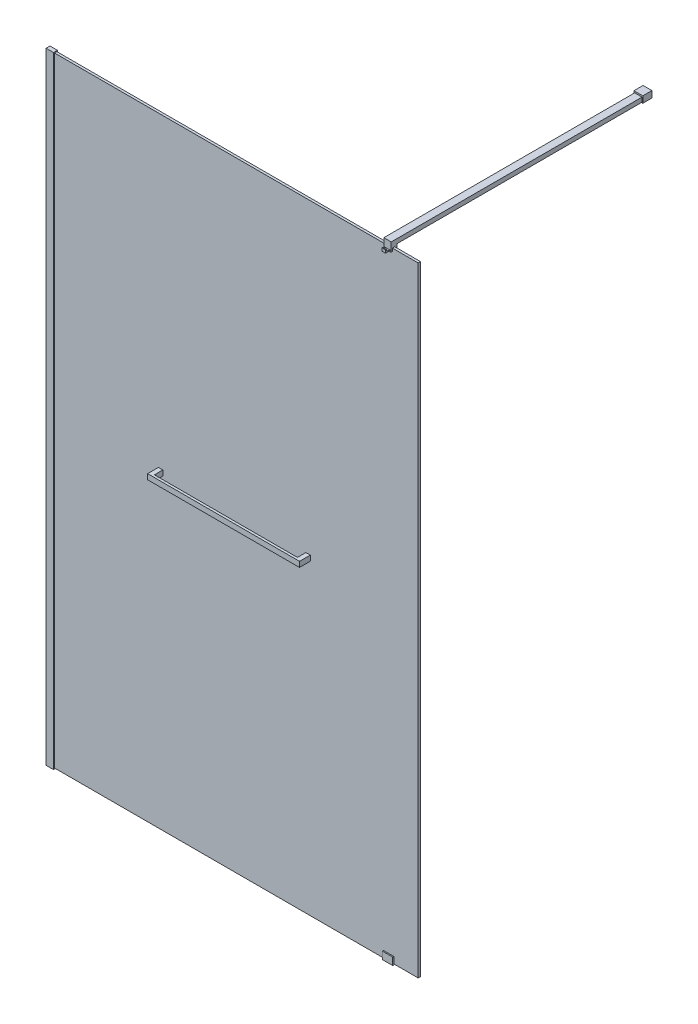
ISO-10303-21;
HEADER;
FILE_DESCRIPTION(('STEP AP214'),'2;1');
FILE_NAME('part.step','',(''),(''),'','','');
FILE_SCHEMA(('AUTOMOTIVE_DESIGN { 1 0 10303 214 1 1 1 1 }'));
ENDSEC;
DATA;
#1=APPLICATION_CONTEXT('core data for automotive mechanical design processes');
#2=APPLICATION_PROTOCOL_DEFINITION('international standard','automotive_design',2000,#1);
#3=PRODUCT_CONTEXT('',#1,'mechanical');
#4=PRODUCT('Part','Part','',(#3));
#5=PRODUCT_RELATED_PRODUCT_CATEGORY('part','',(#4));
#6=PRODUCT_DEFINITION_FORMATION('','',#4);
#7=PRODUCT_DEFINITION_CONTEXT('part definition',#1,'design');
#8=PRODUCT_DEFINITION('design','',#6,#7);
#9=PRODUCT_DEFINITION_SHAPE('','',#8);
#10=(LENGTH_UNIT() NAMED_UNIT(*) SI_UNIT(.MILLI.,.METRE.));
#11=(NAMED_UNIT(*) PLANE_ANGLE_UNIT() SI_UNIT($,.RADIAN.));
#12=(NAMED_UNIT(*) SI_UNIT($,.STERADIAN.) SOLID_ANGLE_UNIT());
#13=UNCERTAINTY_MEASURE_WITH_UNIT(LENGTH_MEASURE(1.E-05),#10,'distance_accuracy_value','');
#14=(GEOMETRIC_REPRESENTATION_CONTEXT(3) GLOBAL_UNCERTAINTY_ASSIGNED_CONTEXT((#13)) GLOBAL_UNIT_ASSIGNED_CONTEXT((#10,
#11,#12)) REPRESENTATION_CONTEXT('',''));
#15=CARTESIAN_POINT('',(0.,0.,0.));
#16=DIRECTION('',(0.,0.,1.));
#17=DIRECTION('',(1.,0.,0.));
#18=AXIS2_PLACEMENT_3D('',#15,#16,#17);
#19=CARTESIAN_POINT('',(892.45,1045.72,-21.6));
#20=DIRECTION('',(1.,0.,0.));
#21=DIRECTION('',(0.,0.,-1.));
#22=AXIS2_PLACEMENT_3D('',#19,#20,#21);
#23=PLANE('',#22);
#24=DIRECTION('',(0.,0.,-1.));
#25=VECTOR('',#24,1.);
#26=CARTESIAN_POINT('',(892.45,1053.72,-21.6));
#27=LINE('',#26,#25);
#28=CARTESIAN_POINT('',(892.45,1053.72,-21.6));
#29=VERTEX_POINT('',#28);
#30=CARTESIAN_POINT('',(892.45,1053.72,-101.6));
#31=VERTEX_POINT('',#30);
#32=EDGE_CURVE('E110',#29,#31,#27,.T.);
#33=ORIENTED_EDGE('',*,*,#32,.F.);
#34=DIRECTION('',(0.,1.,0.));
#35=VECTOR('',#34,1.);
#36=CARTESIAN_POINT('',(892.45,1045.72,-21.6));
#37=LINE('',#36,#35);
#38=CARTESIAN_POINT('',(892.45,1045.72,-21.6));
#39=VERTEX_POINT('',#38);
#40=EDGE_CURVE('E12',#39,#29,#37,.T.);
#41=ORIENTED_EDGE('',*,*,#40,.F.);
#42=DIRECTION('',(0.,0.,-1.));
#43=VECTOR('',#42,1.);
#44=CARTESIAN_POINT('',(892.45,1045.72,-21.6));
#45=LINE('',#44,#43);
#46=CARTESIAN_POINT('',(892.45,1045.72,-101.6));
#47=VERTEX_POINT('',#46);
#48=EDGE_CURVE('E104',#39,#47,#45,.T.);
#49=ORIENTED_EDGE('',*,*,#48,.T.);
#50=DIRECTION('',(0.,1.,0.));
#51=VECTOR('',#50,1.);
#52=CARTESIAN_POINT('',(892.45,1045.72,-101.6));
#53=LINE('',#52,#51);
#54=EDGE_CURVE('E49',#47,#31,#53,.T.);
#55=ORIENTED_EDGE('',*,*,#54,.T.);
#56=EDGE_LOOP('',(#33,#41,#49,#55));
#57=FACE_BOUND('',#56,.T.);
#58=ADVANCED_FACE('F46',(#57),#23,.T.);
#59=CARTESIAN_POINT('',(892.45,1045.72,-21.6));
#60=DIRECTION('',(0.,0.,1.));
#61=DIRECTION('',(1.,0.,0.));
#62=AXIS2_PLACEMENT_3D('',#59,#60,#61);
#63=PLANE('',#62);
#64=DIRECTION('',(1.,0.,0.));
#65=VECTOR('',#64,1.);
#66=CARTESIAN_POINT('',(892.45,1053.72,-21.6));
#67=LINE('',#66,#65);
#68=CARTESIAN_POINT('',(377.45,1053.72,-21.5999999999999));
#69=VERTEX_POINT('',#68);
#70=EDGE_CURVE('E106',#69,#29,#67,.T.);
#71=ORIENTED_EDGE('',*,*,#70,.F.);
#72=DIRECTION('',(0.,1.,0.));
#73=VECTOR('',#72,1.);
#74=CARTESIAN_POINT('',(377.45,1045.72,-21.5999999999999));
#75=LINE('',#74,#73);
#76=CARTESIAN_POINT('',(377.45,1045.72,-21.5999999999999));
#77=VERTEX_POINT('',#76);
#78=EDGE_CURVE('E55',#77,#69,#75,.T.);
#79=ORIENTED_EDGE('',*,*,#78,.F.);
#80=DIRECTION('',(1.,0.,0.));
#81=VECTOR('',#80,1.);
#82=CARTESIAN_POINT('',(892.45,1045.72,-21.6));
#83=LINE('',#82,#81);
#84=EDGE_CURVE('E101',#77,#39,#83,.T.);
#85=ORIENTED_EDGE('',*,*,#84,.T.);
#86=ORIENTED_EDGE('',*,*,#40,.T.);
#87=EDGE_LOOP('',(#71,#79,#85,#86));
#88=FACE_BOUND('',#87,.T.);
#89=ADVANCED_FACE('F120',(#88),#63,.T.);
#90=CARTESIAN_POINT('',(377.45,1045.72,-21.5999999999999));
#91=DIRECTION('',(-1.,0.,0.));
#92=DIRECTION('',(0.,0.,1.));
#93=AXIS2_PLACEMENT_3D('',#90,#91,#92);
#94=PLANE('',#93);
#95=DIRECTION('',(0.,0.,1.));
#96=VECTOR('',#95,1.);
#97=CARTESIAN_POINT('',(377.45,1053.72,-21.5999999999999));
#98=LINE('',#97,#96);
#99=CARTESIAN_POINT('',(377.45,1053.72,-101.6));
#100=VERTEX_POINT('',#99);
#101=EDGE_CURVE('E96',#100,#69,#98,.T.);
#102=ORIENTED_EDGE('',*,*,#101,.F.);
#103=DIRECTION('',(0.,1.,0.));
#104=VECTOR('',#103,1.);
#105=CARTESIAN_POINT('',(377.45,1045.72,-101.6));
#106=LINE('',#105,#104);
#107=CARTESIAN_POINT('',(377.45,1045.72,-101.6));
#108=VERTEX_POINT('',#107);
#109=EDGE_CURVE('E91',#108,#100,#106,.T.);
#110=ORIENTED_EDGE('',*,*,#109,.F.);
#111=DIRECTION('',(0.,0.,1.));
#112=VECTOR('',#111,1.);
#113=CARTESIAN_POINT('',(377.45,1045.72,-21.5999999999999));
#114=LINE('',#113,#112);
#115=EDGE_CURVE('E94',#108,#77,#114,.T.);
#116=ORIENTED_EDGE('',*,*,#115,.T.);
#117=ORIENTED_EDGE('',*,*,#78,.T.);
#118=EDGE_LOOP('',(#102,#110,#116,#117));
#119=FACE_BOUND('',#118,.T.);
#120=ADVANCED_FACE('F93',(#119),#94,.T.);
#121=CARTESIAN_POINT('',(892.45,1045.72,-101.6));
#122=DIRECTION('',(0.,0.,-1.));
#123=DIRECTION('',(-1.,0.,0.));
#124=AXIS2_PLACEMENT_3D('',#121,#122,#123);
#125=PLANE('',#124);
#126=DIRECTION('',(-1.,0.,0.));
#127=VECTOR('',#126,1.);
#128=CARTESIAN_POINT('',(892.45,1053.72,-101.6));
#129=LINE('',#128,#127);
#130=EDGE_CURVE('E113',#31,#100,#129,.T.);
#131=ORIENTED_EDGE('',*,*,#130,.F.);
#132=ORIENTED_EDGE('',*,*,#54,.F.);
#133=DIRECTION('',(-1.,0.,0.));
#134=VECTOR('',#133,1.);
#135=CARTESIAN_POINT('',(892.45,1045.72,-101.6));
#136=LINE('',#135,#134);
#137=EDGE_CURVE('E100',#47,#108,#136,.T.);
#138=ORIENTED_EDGE('',*,*,#137,.T.);
#139=ORIENTED_EDGE('',*,*,#109,.T.);
#140=EDGE_LOOP('',(#131,#132,#138,#139));
#141=FACE_BOUND('',#140,.T.);
#142=ADVANCED_FACE('F103',(#141),#125,.T.);
#143=CARTESIAN_POINT('',(892.45,1045.72,-101.6));
#144=DIRECTION('',(0.,1.,0.));
#145=DIRECTION('',(0.,0.,1.));
#146=AXIS2_PLACEMENT_3D('',#143,#144,#145);
#147=PLANE('',#146);
#148=ORIENTED_EDGE('',*,*,#48,.F.);
#149=ORIENTED_EDGE('',*,*,#84,.F.);
#150=ORIENTED_EDGE('',*,*,#115,.F.);
#151=ORIENTED_EDGE('',*,*,#137,.F.);
#152=EDGE_LOOP('',(#148,#149,#150,#151));
#153=FACE_BOUND('',#152,.T.);
#154=ADVANCED_FACE('F99',(#153),#147,.F.);
#155=CARTESIAN_POINT('',(892.45,1053.72,-101.6));
#156=DIRECTION('',(0.,1.,0.));
#157=DIRECTION('',(0.,0.,1.));
#158=AXIS2_PLACEMENT_3D('',#155,#156,#157);
#159=PLANE('',#158);
#160=ORIENTED_EDGE('',*,*,#32,.T.);
#161=ORIENTED_EDGE('',*,*,#130,.T.);
#162=ORIENTED_EDGE('',*,*,#101,.T.);
#163=ORIENTED_EDGE('',*,*,#70,.T.);
#164=EDGE_LOOP('',(#160,#161,#162,#163));
#165=FACE_BOUND('',#164,.T.);
#166=ADVANCED_FACE('F119',(#165),#159,.T.);
#167=CLOSED_SHELL('',(#58,#89,#120,#142,#154,#166));
#168=MANIFOLD_SOLID_BREP('B2',#167);
#169=CARTESIAN_POINT('',(392.45,1041.,-34.4));
#170=DIRECTION('',(0.,0.,1.));
#171=DIRECTION('',(1.,0.,0.));
#172=AXIS2_PLACEMENT_3D('',#169,#170,#171);
#173=PLANE('',#172);
#174=DIRECTION('',(0.,-1.,0.));
#175=VECTOR('',#174,1.);
#176=CARTESIAN_POINT('',(377.45,1059.,-34.4));
#177=LINE('',#176,#175);
#178=CARTESIAN_POINT('',(377.45,1045.73,-34.4));
#179=VERTEX_POINT('',#178);
#180=CARTESIAN_POINT('',(377.45,1041.,-34.4));
#181=VERTEX_POINT('',#180);
#182=EDGE_CURVE('E415',#179,#181,#177,.T.);
#183=ORIENTED_EDGE('',*,*,#182,.F.);
#184=DIRECTION('',(1.,0.,0.));
#185=VECTOR('',#184,1.);
#186=CARTESIAN_POINT('',(392.45,1045.73,-34.4));
#187=LINE('',#186,#185);
#188=CARTESIAN_POINT('',(392.45,1045.73,-34.4));
#189=VERTEX_POINT('',#188);
#190=EDGE_CURVE('E44',#179,#189,#187,.T.);
#191=ORIENTED_EDGE('',*,*,#190,.T.);
#192=DIRECTION('',(0.,1.,0.));
#193=VECTOR('',#192,1.);
#194=CARTESIAN_POINT('',(392.45,1059.,-34.4));
#195=LINE('',#194,#193);
#196=CARTESIAN_POINT('',(392.45,1041.,-34.4));
#197=VERTEX_POINT('',#196);
#198=EDGE_CURVE('E420',#197,#189,#195,.T.);
#199=ORIENTED_EDGE('',*,*,#198,.F.);
#200=DIRECTION('',(1.,0.,0.));
#201=VECTOR('',#200,1.);
#202=CARTESIAN_POINT('',(377.45,1041.,-34.4));
#203=LINE('',#202,#201);
#204=EDGE_CURVE('E394',#181,#197,#203,.T.);
#205=ORIENTED_EDGE('',*,*,#204,.F.);
#206=EDGE_LOOP('',(#183,#191,#199,#205));
#207=FACE_BOUND('',#206,.T.);
#208=ADVANCED_FACE('F180',(#207),#173,.F.);
#209=CARTESIAN_POINT('',(392.45,1059.,-34.4));
#210=DIRECTION('',(1.,0.,0.));
#211=DIRECTION('',(0.,0.,-1.));
#212=AXIS2_PLACEMENT_3D('',#209,#210,#211);
#213=PLANE('',#212);
#214=DIRECTION('',(0.,1.,0.));
#215=VECTOR('',#214,1.);
#216=CARTESIAN_POINT('',(392.45,1059.,25.1));
#217=LINE('',#216,#215);
#218=CARTESIAN_POINT('',(392.45,1041.,25.1));
#219=VERTEX_POINT('',#218);
#220=CARTESIAN_POINT('',(392.45,1059.,25.1));
#221=VERTEX_POINT('',#220);
#222=EDGE_CURVE('E198',#219,#221,#217,.T.);
#223=ORIENTED_EDGE('',*,*,#222,.F.);
#224=DIRECTION('',(0.,0.,1.));
#225=VECTOR('',#224,1.);
#226=CARTESIAN_POINT('',(392.45,1041.,-34.4));
#227=LINE('',#226,#225);
#228=EDGE_CURVE('E385',#197,#219,#227,.T.);
#229=ORIENTED_EDGE('',*,*,#228,.F.);
#230=ORIENTED_EDGE('',*,*,#198,.T.);
#231=DIRECTION('',(0.,0.,-1.));
#232=VECTOR('',#231,1.);
#233=CARTESIAN_POINT('',(392.45,1045.73,-34.4));
#234=LINE('',#233,#232);
#235=CARTESIAN_POINT('',(392.45,1045.73,-21.6));
#236=VERTEX_POINT('',#235);
#237=EDGE_CURVE('E433',#236,#189,#234,.T.);
#238=ORIENTED_EDGE('',*,*,#237,.F.);
#239=DIRECTION('',(0.,-1.,0.));
#240=VECTOR('',#239,1.);
#241=CARTESIAN_POINT('',(392.45,1059.,-21.6));
#242=LINE('',#241,#240);
#243=CARTESIAN_POINT('',(392.45,1053.73,-21.6));
#244=VERTEX_POINT('',#243);
#245=EDGE_CURVE('E431',#244,#236,#242,.T.);
#246=ORIENTED_EDGE('',*,*,#245,.F.);
#247=DIRECTION('',(0.,0.,1.));
#248=VECTOR('',#247,1.);
#249=CARTESIAN_POINT('',(392.45,1053.73,-34.4));
#250=LINE('',#249,#248);
#251=CARTESIAN_POINT('',(392.45,1053.73,-34.4));
#252=VERTEX_POINT('',#251);
#253=EDGE_CURVE('E435',#252,#244,#250,.T.);
#254=ORIENTED_EDGE('',*,*,#253,.F.);
#255=CARTESIAN_POINT('',(392.45,1059.,-34.4));
#256=VERTEX_POINT('',#255);
#257=EDGE_CURVE('E408',#252,#256,#195,.T.);
#258=ORIENTED_EDGE('',*,*,#257,.T.);
#259=DIRECTION('',(0.,0.,1.));
#260=VECTOR('',#259,1.);
#261=CARTESIAN_POINT('',(392.45,1059.,-34.4));
#262=LINE('',#261,#260);
#263=EDGE_CURVE('E389',#256,#221,#262,.T.);
#264=ORIENTED_EDGE('',*,*,#263,.T.);
#265=EDGE_LOOP('',(#223,#229,#230,#238,#246,#254,#258,#264));
#266=FACE_BOUND('',#265,.T.);
#267=ADVANCED_FACE('F182',(#266),#213,.T.);
#268=CARTESIAN_POINT('',(377.45,1041.,-34.4));
#269=DIRECTION('',(0.,-1.,0.));
#270=DIRECTION('',(0.,0.,-1.));
#271=AXIS2_PLACEMENT_3D('',#268,#269,#270);
#272=PLANE('',#271);
#273=ORIENTED_EDGE('',*,*,#228,.T.);
#274=DIRECTION('',(-1.,0.,0.));
#275=VECTOR('',#274,1.);
#276=CARTESIAN_POINT('',(897.147715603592,1041.,25.1));
#277=LINE('',#276,#275);
#278=CARTESIAN_POINT('',(877.45,1041.,25.1));
#279=VERTEX_POINT('',#278);
#280=EDGE_CURVE('E373',#279,#219,#277,.T.);
#281=ORIENTED_EDGE('',*,*,#280,.F.);
#282=DIRECTION('',(0.,0.,1.));
#283=VECTOR('',#282,1.);
#284=CARTESIAN_POINT('',(877.45,1041.,-34.4));
#285=LINE('',#284,#283);
#286=CARTESIAN_POINT('',(877.45,1041.,-34.4));
#287=VERTEX_POINT('',#286);
#288=EDGE_CURVE('E352',#287,#279,#285,.T.);
#289=ORIENTED_EDGE('',*,*,#288,.F.);
#290=DIRECTION('',(1.,0.,0.));
#291=VECTOR('',#290,1.);
#292=CARTESIAN_POINT('',(877.45,1041.,-34.4));
#293=LINE('',#292,#291);
#294=CARTESIAN_POINT('',(892.45,1041.,-34.4));
#295=VERTEX_POINT('',#294);
#296=EDGE_CURVE('E344',#287,#295,#293,.T.);
#297=ORIENTED_EDGE('',*,*,#296,.T.);
#298=DIRECTION('',(0.,0.,1.));
#299=VECTOR('',#298,1.);
#300=CARTESIAN_POINT('',(892.45,1041.,-34.4));
#301=LINE('',#300,#299);
#302=CARTESIAN_POINT('',(892.45,1041.,33.1));
#303=VERTEX_POINT('',#302);
#304=EDGE_CURVE('E348',#295,#303,#301,.T.);
#305=ORIENTED_EDGE('',*,*,#304,.T.);
#306=DIRECTION('',(1.,0.,0.));
#307=VECTOR('',#306,1.);
#308=CARTESIAN_POINT('',(377.45,1041.,33.1));
#309=LINE('',#308,#307);
#310=CARTESIAN_POINT('',(377.45,1041.,33.1));
#311=VERTEX_POINT('',#310);
#312=EDGE_CURVE('E423',#311,#303,#309,.T.);
#313=ORIENTED_EDGE('',*,*,#312,.F.);
#314=DIRECTION('',(0.,0.,1.));
#315=VECTOR('',#314,1.);
#316=CARTESIAN_POINT('',(377.45,1041.,-34.4));
#317=LINE('',#316,#315);
#318=EDGE_CURVE('E388',#181,#311,#317,.T.);
#319=ORIENTED_EDGE('',*,*,#318,.F.);
#320=ORIENTED_EDGE('',*,*,#204,.T.);
#321=EDGE_LOOP('',(#273,#281,#289,#297,#305,#313,#319,#320));
#322=FACE_BOUND('',#321,.T.);
#323=ADVANCED_FACE('F456',(#322),#272,.T.);
#324=CARTESIAN_POINT('',(377.45,1059.,-34.4));
#325=DIRECTION('',(-1.,0.,0.));
#326=DIRECTION('',(0.,0.,1.));
#327=AXIS2_PLACEMENT_3D('',#324,#325,#326);
#328=PLANE('',#327);
#329=DIRECTION('',(0.,0.,1.));
#330=VECTOR('',#329,1.);
#331=CARTESIAN_POINT('',(377.45,1045.73,-34.4));
#332=LINE('',#331,#330);
#333=CARTESIAN_POINT('',(377.45,1045.73,-21.6));
#334=VERTEX_POINT('',#333);
#335=EDGE_CURVE('E379',#179,#334,#332,.T.);
#336=ORIENTED_EDGE('',*,*,#335,.F.);
#337=ORIENTED_EDGE('',*,*,#182,.T.);
#338=ORIENTED_EDGE('',*,*,#318,.T.);
#339=DIRECTION('',(0.,-1.,0.));
#340=VECTOR('',#339,1.);
#341=CARTESIAN_POINT('',(377.45,1059.,33.1));
#342=LINE('',#341,#340);
#343=CARTESIAN_POINT('',(377.45,1059.,33.1));
#344=VERTEX_POINT('',#343);
#345=EDGE_CURVE('E425',#344,#311,#342,.T.);
#346=ORIENTED_EDGE('',*,*,#345,.F.);
#347=DIRECTION('',(0.,0.,1.));
#348=VECTOR('',#347,1.);
#349=CARTESIAN_POINT('',(377.45,1059.,-34.4));
#350=LINE('',#349,#348);
#351=CARTESIAN_POINT('',(377.45,1059.,-34.4));
#352=VERTEX_POINT('',#351);
#353=EDGE_CURVE('E397',#352,#344,#350,.T.);
#354=ORIENTED_EDGE('',*,*,#353,.F.);
#355=CARTESIAN_POINT('',(377.45,1053.73,-34.4));
#356=VERTEX_POINT('',#355);
#357=EDGE_CURVE('E406',#352,#356,#177,.T.);
#358=ORIENTED_EDGE('',*,*,#357,.T.);
#359=DIRECTION('',(0.,0.,-1.));
#360=VECTOR('',#359,1.);
#361=CARTESIAN_POINT('',(377.45,1053.73,-34.4));
#362=LINE('',#361,#360);
#363=CARTESIAN_POINT('',(377.45,1053.73,-21.6));
#364=VERTEX_POINT('',#363);
#365=EDGE_CURVE('E206',#364,#356,#362,.T.);
#366=ORIENTED_EDGE('',*,*,#365,.F.);
#367=DIRECTION('',(0.,1.,0.));
#368=VECTOR('',#367,1.);
#369=CARTESIAN_POINT('',(377.45,1053.73,-21.6));
#370=LINE('',#369,#368);
#371=EDGE_CURVE('E442',#334,#364,#370,.T.);
#372=ORIENTED_EDGE('',*,*,#371,.F.);
#373=EDGE_LOOP('',(#336,#337,#338,#346,#354,#358,#366,#372));
#374=FACE_BOUND('',#373,.T.);
#375=ADVANCED_FACE('F412',(#374),#328,.T.);
#376=CARTESIAN_POINT('',(377.45,1059.,-34.4));
#377=DIRECTION('',(0.,1.,0.));
#378=DIRECTION('',(0.,0.,1.));
#379=AXIS2_PLACEMENT_3D('',#376,#377,#378);
#380=PLANE('',#379);
#381=ORIENTED_EDGE('',*,*,#353,.T.);
#382=DIRECTION('',(-1.,0.,0.));
#383=VECTOR('',#382,1.);
#384=CARTESIAN_POINT('',(377.45,1059.,33.1));
#385=LINE('',#384,#383);
#386=CARTESIAN_POINT('',(892.45,1059.,33.1));
#387=VERTEX_POINT('',#386);
#388=EDGE_CURVE('E428',#387,#344,#385,.T.);
#389=ORIENTED_EDGE('',*,*,#388,.F.);
#390=DIRECTION('',(0.,0.,1.));
#391=VECTOR('',#390,1.);
#392=CARTESIAN_POINT('',(892.45,1059.,-34.4));
#393=LINE('',#392,#391);
#394=CARTESIAN_POINT('',(892.45,1059.,-34.4));
#395=VERTEX_POINT('',#394);
#396=EDGE_CURVE('E347',#395,#387,#393,.T.);
#397=ORIENTED_EDGE('',*,*,#396,.F.);
#398=DIRECTION('',(-1.,0.,0.));
#399=VECTOR('',#398,1.);
#400=CARTESIAN_POINT('',(877.45,1059.,-34.4));
#401=LINE('',#400,#399);
#402=CARTESIAN_POINT('',(877.45,1059.,-34.4));
#403=VERTEX_POINT('',#402);
#404=EDGE_CURVE('E337',#395,#403,#401,.T.);
#405=ORIENTED_EDGE('',*,*,#404,.T.);
#406=DIRECTION('',(0.,0.,1.));
#407=VECTOR('',#406,1.);
#408=CARTESIAN_POINT('',(877.45,1059.,-34.4));
#409=LINE('',#408,#407);
#410=CARTESIAN_POINT('',(877.45,1059.,25.1));
#411=VERTEX_POINT('',#410);
#412=EDGE_CURVE('E360',#403,#411,#409,.T.);
#413=ORIENTED_EDGE('',*,*,#412,.T.);
#414=DIRECTION('',(-1.,0.,0.));
#415=VECTOR('',#414,1.);
#416=CARTESIAN_POINT('',(897.147715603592,1059.,25.1));
#417=LINE('',#416,#415);
#418=EDGE_CURVE('E370',#411,#221,#417,.T.);
#419=ORIENTED_EDGE('',*,*,#418,.T.);
#420=ORIENTED_EDGE('',*,*,#263,.F.);
#421=DIRECTION('',(-1.,0.,0.));
#422=VECTOR('',#421,1.);
#423=CARTESIAN_POINT('',(377.45,1059.,-34.4));
#424=LINE('',#423,#422);
#425=EDGE_CURVE('E417',#256,#352,#424,.T.);
#426=ORIENTED_EDGE('',*,*,#425,.T.);
#427=EDGE_LOOP('',(#381,#389,#397,#405,#413,#419,#420,#426));
#428=FACE_BOUND('',#427,.T.);
#429=ADVANCED_FACE('F463',(#428),#380,.T.);
#430=ORIENTED_EDGE('',*,*,#257,.F.);
#431=DIRECTION('',(-1.,0.,0.));
#432=VECTOR('',#431,1.);
#433=CARTESIAN_POINT('',(392.45,1053.73,-34.4));
#434=LINE('',#433,#432);
#435=EDGE_CURVE('E190',#252,#356,#434,.T.);
#436=ORIENTED_EDGE('',*,*,#435,.T.);
#437=ORIENTED_EDGE('',*,*,#357,.F.);
#438=ORIENTED_EDGE('',*,*,#425,.F.);
#439=EDGE_LOOP('',(#430,#436,#437,#438));
#440=FACE_BOUND('',#439,.T.);
#441=ADVANCED_FACE('F404',(#440),#173,.F.);
#442=CARTESIAN_POINT('',(392.45,1041.,33.1));
#443=DIRECTION('',(0.,0.,1.));
#444=DIRECTION('',(1.,0.,0.));
#445=AXIS2_PLACEMENT_3D('',#442,#443,#444);
#446=PLANE('',#445);
#447=ORIENTED_EDGE('',*,*,#312,.T.);
#448=DIRECTION('',(0.,1.,0.));
#449=VECTOR('',#448,1.);
#450=CARTESIAN_POINT('',(892.45,1059.,33.1));
#451=LINE('',#450,#449);
#452=EDGE_CURVE('E332',#303,#387,#451,.T.);
#453=ORIENTED_EDGE('',*,*,#452,.T.);
#454=ORIENTED_EDGE('',*,*,#388,.T.);
#455=ORIENTED_EDGE('',*,*,#345,.T.);
#456=EDGE_LOOP('',(#447,#453,#454,#455));
#457=FACE_BOUND('',#456,.T.);
#458=ADVANCED_FACE('F459',(#457),#446,.T.);
#459=CARTESIAN_POINT('',(907.544369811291,1045.73,-34.4));
#460=DIRECTION('',(0.,-1.,0.));
#461=DIRECTION('',(0.,0.,-1.));
#462=AXIS2_PLACEMENT_3D('',#459,#460,#461);
#463=PLANE('',#462);
#464=ORIENTED_EDGE('',*,*,#237,.T.);
#465=ORIENTED_EDGE('',*,*,#190,.F.);
#466=ORIENTED_EDGE('',*,*,#335,.T.);
#467=DIRECTION('',(-1.,0.,0.));
#468=VECTOR('',#467,1.);
#469=CARTESIAN_POINT('',(907.544369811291,1045.73,-21.6));
#470=LINE('',#469,#468);
#471=EDGE_CURVE('E438',#236,#334,#470,.T.);
#472=ORIENTED_EDGE('',*,*,#471,.F.);
#473=EDGE_LOOP('',(#464,#465,#466,#472));
#474=FACE_BOUND('',#473,.T.);
#475=ADVANCED_FACE('F498',(#474),#463,.F.);
#476=CARTESIAN_POINT('',(907.544369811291,1053.73,-21.6));
#477=DIRECTION('',(0.,0.,1.));
#478=DIRECTION('',(1.,0.,0.));
#479=AXIS2_PLACEMENT_3D('',#476,#477,#478);
#480=PLANE('',#479);
#481=ORIENTED_EDGE('',*,*,#245,.T.);
#482=ORIENTED_EDGE('',*,*,#471,.T.);
#483=ORIENTED_EDGE('',*,*,#371,.T.);
#484=DIRECTION('',(-1.,0.,0.));
#485=VECTOR('',#484,1.);
#486=CARTESIAN_POINT('',(907.544369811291,1053.73,-21.6));
#487=LINE('',#486,#485);
#488=EDGE_CURVE('E437',#244,#364,#487,.T.);
#489=ORIENTED_EDGE('',*,*,#488,.F.);
#490=EDGE_LOOP('',(#481,#482,#483,#489));
#491=FACE_BOUND('',#490,.T.);
#492=ADVANCED_FACE('F446',(#491),#480,.F.);
#493=CARTESIAN_POINT('',(907.544369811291,1053.73,-34.4));
#494=DIRECTION('',(0.,1.,0.));
#495=DIRECTION('',(0.,0.,1.));
#496=AXIS2_PLACEMENT_3D('',#493,#494,#495);
#497=PLANE('',#496);
#498=ORIENTED_EDGE('',*,*,#253,.T.);
#499=ORIENTED_EDGE('',*,*,#488,.T.);
#500=ORIENTED_EDGE('',*,*,#365,.T.);
#501=ORIENTED_EDGE('',*,*,#435,.F.);
#502=EDGE_LOOP('',(#498,#499,#500,#501));
#503=FACE_BOUND('',#502,.T.);
#504=ADVANCED_FACE('F538',(#503),#497,.F.);
#505=CARTESIAN_POINT('',(897.147715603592,1059.,25.1));
#506=DIRECTION('',(0.,0.,1.));
#507=DIRECTION('',(0.,-1.,0.));
#508=AXIS2_PLACEMENT_3D('',#505,#506,#507);
#509=PLANE('',#508);
#510=ORIENTED_EDGE('',*,*,#418,.F.);
#511=DIRECTION('',(0.,-1.,0.));
#512=VECTOR('',#511,1.);
#513=CARTESIAN_POINT('',(877.45,1059.,25.1));
#514=LINE('',#513,#512);
#515=EDGE_CURVE('E184',#411,#279,#514,.T.);
#516=ORIENTED_EDGE('',*,*,#515,.T.);
#517=ORIENTED_EDGE('',*,*,#280,.T.);
#518=ORIENTED_EDGE('',*,*,#222,.T.);
#519=EDGE_LOOP('',(#510,#516,#517,#518));
#520=FACE_BOUND('',#519,.T.);
#521=ADVANCED_FACE('F470',(#520),#509,.F.);
#522=CARTESIAN_POINT('',(877.45,1059.,-34.4));
#523=DIRECTION('',(-1.,0.,0.));
#524=DIRECTION('',(0.,0.,1.));
#525=AXIS2_PLACEMENT_3D('',#522,#523,#524);
#526=PLANE('',#525);
#527=ORIENTED_EDGE('',*,*,#515,.F.);
#528=ORIENTED_EDGE('',*,*,#412,.F.);
#529=DIRECTION('',(0.,-1.,0.));
#530=VECTOR('',#529,1.);
#531=CARTESIAN_POINT('',(877.45,1059.,-34.4));
#532=LINE('',#531,#530);
#533=CARTESIAN_POINT('',(877.45,1053.73,-34.4));
#534=VERTEX_POINT('',#533);
#535=EDGE_CURVE('E341',#403,#534,#532,.T.);
#536=ORIENTED_EDGE('',*,*,#535,.T.);
#537=DIRECTION('',(0.,0.,-1.));
#538=VECTOR('',#537,1.);
#539=CARTESIAN_POINT('',(877.45,1053.73,-34.4));
#540=LINE('',#539,#538);
#541=CARTESIAN_POINT('',(877.45,1053.73,-21.6));
#542=VERTEX_POINT('',#541);
#543=EDGE_CURVE('E329',#542,#534,#540,.T.);
#544=ORIENTED_EDGE('',*,*,#543,.F.);
#545=DIRECTION('',(0.,1.,0.));
#546=VECTOR('',#545,1.);
#547=CARTESIAN_POINT('',(877.45,1059.,-21.6));
#548=LINE('',#547,#546);
#549=CARTESIAN_POINT('',(877.45,1045.73,-21.6));
#550=VERTEX_POINT('',#549);
#551=EDGE_CURVE('E351',#550,#542,#548,.T.);
#552=ORIENTED_EDGE('',*,*,#551,.F.);
#553=DIRECTION('',(0.,0.,1.));
#554=VECTOR('',#553,1.);
#555=CARTESIAN_POINT('',(877.45,1045.73,-34.4));
#556=LINE('',#555,#554);
#557=CARTESIAN_POINT('',(877.45,1045.73,-34.4));
#558=VERTEX_POINT('',#557);
#559=EDGE_CURVE('E313',#558,#550,#556,.T.);
#560=ORIENTED_EDGE('',*,*,#559,.F.);
#561=EDGE_CURVE('E340',#558,#287,#532,.T.);
#562=ORIENTED_EDGE('',*,*,#561,.T.);
#563=ORIENTED_EDGE('',*,*,#288,.T.);
#564=EDGE_LOOP('',(#527,#528,#536,#544,#552,#560,#562,#563));
#565=FACE_BOUND('',#564,.T.);
#566=ADVANCED_FACE('F471',(#565),#526,.T.);
#567=CARTESIAN_POINT('',(892.45,1041.,-34.4));
#568=DIRECTION('',(0.,0.,1.));
#569=DIRECTION('',(1.,0.,0.));
#570=AXIS2_PLACEMENT_3D('',#567,#568,#569);
#571=PLANE('',#570);
#572=ORIENTED_EDGE('',*,*,#561,.F.);
#573=DIRECTION('',(-1.,0.,0.));
#574=VECTOR('',#573,1.);
#575=CARTESIAN_POINT('',(907.544369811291,1045.73,-34.4));
#576=LINE('',#575,#574);
#577=CARTESIAN_POINT('',(892.45,1045.73,-34.4));
#578=VERTEX_POINT('',#577);
#579=EDGE_CURVE('E326',#578,#558,#576,.T.);
#580=ORIENTED_EDGE('',*,*,#579,.F.);
#581=DIRECTION('',(0.,1.,0.));
#582=VECTOR('',#581,1.);
#583=CARTESIAN_POINT('',(892.45,1059.,-34.4));
#584=LINE('',#583,#582);
#585=EDGE_CURVE('E318',#295,#578,#584,.T.);
#586=ORIENTED_EDGE('',*,*,#585,.F.);
#587=ORIENTED_EDGE('',*,*,#296,.F.);
#588=EDGE_LOOP('',(#572,#580,#586,#587));
#589=FACE_BOUND('',#588,.T.);
#590=ADVANCED_FACE('F476',(#589),#571,.F.);
#591=CARTESIAN_POINT('',(892.45,1059.,-34.4));
#592=DIRECTION('',(1.,0.,0.));
#593=DIRECTION('',(0.,0.,-1.));
#594=AXIS2_PLACEMENT_3D('',#591,#592,#593);
#595=PLANE('',#594);
#596=DIRECTION('',(0.,0.,1.));
#597=VECTOR('',#596,1.);
#598=CARTESIAN_POINT('',(892.45,1045.73,-34.4));
#599=LINE('',#598,#597);
#600=CARTESIAN_POINT('',(892.45,1045.73,-21.6));
#601=VERTEX_POINT('',#600);
#602=EDGE_CURVE('E310',#578,#601,#599,.T.);
#603=ORIENTED_EDGE('',*,*,#602,.T.);
#604=DIRECTION('',(0.,1.,0.));
#605=VECTOR('',#604,1.);
#606=CARTESIAN_POINT('',(892.45,1053.73,-21.6));
#607=LINE('',#606,#605);
#608=CARTESIAN_POINT('',(892.45,1053.73,-21.6));
#609=VERTEX_POINT('',#608);
#610=EDGE_CURVE('E297',#601,#609,#607,.T.);
#611=ORIENTED_EDGE('',*,*,#610,.T.);
#612=DIRECTION('',(0.,0.,-1.));
#613=VECTOR('',#612,1.);
#614=CARTESIAN_POINT('',(892.45,1053.73,-34.4));
#615=LINE('',#614,#613);
#616=CARTESIAN_POINT('',(892.45,1053.73,-34.4));
#617=VERTEX_POINT('',#616);
#618=EDGE_CURVE('E321',#609,#617,#615,.T.);
#619=ORIENTED_EDGE('',*,*,#618,.T.);
#620=EDGE_CURVE('E335',#617,#395,#584,.T.);
#621=ORIENTED_EDGE('',*,*,#620,.T.);
#622=ORIENTED_EDGE('',*,*,#396,.T.);
#623=ORIENTED_EDGE('',*,*,#452,.F.);
#624=ORIENTED_EDGE('',*,*,#304,.F.);
#625=ORIENTED_EDGE('',*,*,#585,.T.);
#626=EDGE_LOOP('',(#603,#611,#619,#621,#622,#623,#624,#625));
#627=FACE_BOUND('',#626,.T.);
#628=ADVANCED_FACE('F316',(#627),#595,.T.);
#629=ORIENTED_EDGE('',*,*,#620,.F.);
#630=DIRECTION('',(-1.,0.,0.));
#631=VECTOR('',#630,1.);
#632=CARTESIAN_POINT('',(907.544369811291,1053.73,-34.4));
#633=LINE('',#632,#631);
#634=EDGE_CURVE('E322',#617,#534,#633,.T.);
#635=ORIENTED_EDGE('',*,*,#634,.T.);
#636=ORIENTED_EDGE('',*,*,#535,.F.);
#637=ORIENTED_EDGE('',*,*,#404,.F.);
#638=EDGE_LOOP('',(#629,#635,#636,#637));
#639=FACE_BOUND('',#638,.T.);
#640=ADVANCED_FACE('F467',(#639),#571,.F.);
#641=CARTESIAN_POINT('',(907.544369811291,1045.73,-34.4));
#642=DIRECTION('',(0.,-1.,0.));
#643=DIRECTION('',(0.,0.,-1.));
#644=AXIS2_PLACEMENT_3D('',#641,#642,#643);
#645=PLANE('',#644);
#646=ORIENTED_EDGE('',*,*,#559,.T.);
#647=DIRECTION('',(-1.,0.,0.));
#648=VECTOR('',#647,1.);
#649=CARTESIAN_POINT('',(907.544369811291,1045.73,-21.6));
#650=LINE('',#649,#648);
#651=EDGE_CURVE('E300',#601,#550,#650,.T.);
#652=ORIENTED_EDGE('',*,*,#651,.F.);
#653=ORIENTED_EDGE('',*,*,#602,.F.);
#654=ORIENTED_EDGE('',*,*,#579,.T.);
#655=EDGE_LOOP('',(#646,#652,#653,#654));
#656=FACE_BOUND('',#655,.T.);
#657=ADVANCED_FACE('F309',(#656),#645,.F.);
#658=CARTESIAN_POINT('',(907.544369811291,1053.73,-21.6));
#659=DIRECTION('',(0.,0.,1.));
#660=DIRECTION('',(1.,0.,0.));
#661=AXIS2_PLACEMENT_3D('',#658,#659,#660);
#662=PLANE('',#661);
#663=ORIENTED_EDGE('',*,*,#551,.T.);
#664=DIRECTION('',(-1.,0.,0.));
#665=VECTOR('',#664,1.);
#666=CARTESIAN_POINT('',(907.544369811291,1053.73,-21.6));
#667=LINE('',#666,#665);
#668=EDGE_CURVE('E303',#609,#542,#667,.T.);
#669=ORIENTED_EDGE('',*,*,#668,.F.);
#670=ORIENTED_EDGE('',*,*,#610,.F.);
#671=ORIENTED_EDGE('',*,*,#651,.T.);
#672=EDGE_LOOP('',(#663,#669,#670,#671));
#673=FACE_BOUND('',#672,.T.);
#674=ADVANCED_FACE('F299',(#673),#662,.F.);
#675=CARTESIAN_POINT('',(907.544369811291,1053.73,-34.4));
#676=DIRECTION('',(0.,1.,0.));
#677=DIRECTION('',(0.,0.,1.));
#678=AXIS2_PLACEMENT_3D('',#675,#676,#677);
#679=PLANE('',#678);
#680=ORIENTED_EDGE('',*,*,#543,.T.);
#681=ORIENTED_EDGE('',*,*,#634,.F.);
#682=ORIENTED_EDGE('',*,*,#618,.F.);
#683=ORIENTED_EDGE('',*,*,#668,.T.);
#684=EDGE_LOOP('',(#680,#681,#682,#683));
#685=FACE_BOUND('',#684,.T.);
#686=ADVANCED_FACE('F479',(#685),#679,.F.);
#687=CLOSED_SHELL('',(#208,#267,#323,#375,#429,#441,#458,#475,#492,#504,#521,#566,#590,#628,
#640,#657,#674,#686));
#688=MANIFOLD_SOLID_BREP('B6',#687);
#689=CARTESIAN_POINT('',(1170.95,2090.,-19.4000000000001));
#690=DIRECTION('',(-1.,0.,0.));
#691=DIRECTION('',(0.,0.,1.));
#692=AXIS2_PLACEMENT_3D('',#689,#690,#691);
#693=PLANE('',#692);
#694=DIRECTION('',(0.,-1.,0.));
#695=VECTOR('',#694,1.);
#696=CARTESIAN_POINT('',(1170.95,2090.,-850.03));
#697=LINE('',#696,#695);
#698=CARTESIAN_POINT('',(1170.95,2120.,-850.03));
#699=VERTEX_POINT('',#698);
#700=CARTESIAN_POINT('',(1170.95,2105.,-850.03));
#701=VERTEX_POINT('',#700);
#702=EDGE_CURVE('E669',#699,#701,#697,.T.);
#703=ORIENTED_EDGE('',*,*,#702,.F.);
#704=DIRECTION('',(0.,0.,1.));
#705=VECTOR('',#704,1.);
#706=CARTESIAN_POINT('',(1170.95,2120.,0.599999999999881));
#707=LINE('',#706,#705);
#708=CARTESIAN_POINT('',(1170.95,2120.,0.599999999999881));
#709=VERTEX_POINT('',#708);
#710=EDGE_CURVE('E994',#699,#709,#707,.T.);
#711=ORIENTED_EDGE('',*,*,#710,.T.);
#712=DIRECTION('',(0.,-1.,0.));
#713=VECTOR('',#712,1.);
#714=CARTESIAN_POINT('',(1170.95,2094.,0.599999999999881));
#715=LINE('',#714,#713);
#716=CARTESIAN_POINT('',(1170.95,2094.,0.599999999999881));
#717=VERTEX_POINT('',#716);
#718=EDGE_CURVE('E996',#709,#717,#715,.T.);
#719=ORIENTED_EDGE('',*,*,#718,.T.);
#720=DIRECTION('',(0.,1.,0.));
#721=VECTOR('',#720,1.);
#722=CARTESIAN_POINT('',(1170.95,2090.,0.599999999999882));
#723=LINE('',#722,#721);
#724=CARTESIAN_POINT('',(1170.95,2090.,0.599999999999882));
#725=VERTEX_POINT('',#724);
#726=EDGE_CURVE('E940',#725,#717,#723,.T.);
#727=ORIENTED_EDGE('',*,*,#726,.F.);
#728=DIRECTION('',(0.,0.,-1.));
#729=VECTOR('',#728,1.);
#730=CARTESIAN_POINT('',(1170.95,2090.,-3.40000000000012));
#731=LINE('',#730,#729);
#732=CARTESIAN_POINT('',(1170.95,2090.,-3.40000000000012));
#733=VERTEX_POINT('',#732);
#734=EDGE_CURVE('E970',#725,#733,#731,.T.);
#735=ORIENTED_EDGE('',*,*,#734,.T.);
#736=DIRECTION('',(0.,1.,-1.30407837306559E-13));
#737=VECTOR('',#736,1.);
#738=CARTESIAN_POINT('',(1170.95,2100.,-3.40000000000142));
#739=LINE('',#738,#737);
#740=CARTESIAN_POINT('',(1170.95,2100.,-3.40000000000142));
#741=VERTEX_POINT('',#740);
#742=EDGE_CURVE('E1000',#733,#741,#739,.T.);
#743=ORIENTED_EDGE('',*,*,#742,.T.);
#744=DIRECTION('',(0.,0.,-1.));
#745=VECTOR('',#744,1.);
#746=CARTESIAN_POINT('',(1170.95,2100.,-11.4000000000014));
#747=LINE('',#746,#745);
#748=CARTESIAN_POINT('',(1170.95,2100.,-11.4000000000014));
#749=VERTEX_POINT('',#748);
#750=EDGE_CURVE('E1002',#741,#749,#747,.T.);
#751=ORIENTED_EDGE('',*,*,#750,.T.);
#752=DIRECTION('',(0.,-1.,1.30451205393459E-13));
#753=VECTOR('',#752,1.);
#754=CARTESIAN_POINT('',(1170.95,2090.,-11.4000000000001));
#755=LINE('',#754,#753);
#756=CARTESIAN_POINT('',(1170.95,2090.,-11.4000000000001));
#757=VERTEX_POINT('',#756);
#758=EDGE_CURVE('E1003',#749,#757,#755,.T.);
#759=ORIENTED_EDGE('',*,*,#758,.T.);
#760=DIRECTION('',(0.,0.,-1.));
#761=VECTOR('',#760,1.);
#762=CARTESIAN_POINT('',(1170.95,2090.,-19.4000000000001));
#763=LINE('',#762,#761);
#764=CARTESIAN_POINT('',(1170.95,2090.,-19.4000000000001));
#765=VERTEX_POINT('',#764);
#766=EDGE_CURVE('E891',#757,#765,#763,.T.);
#767=ORIENTED_EDGE('',*,*,#766,.T.);
#768=DIRECTION('',(0.,1.,0.));
#769=VECTOR('',#768,1.);
#770=CARTESIAN_POINT('',(1170.95,2120.,-19.4000000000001));
#771=LINE('',#770,#769);
#772=CARTESIAN_POINT('',(1170.95,2105.,-19.4000000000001));
#773=VERTEX_POINT('',#772);
#774=EDGE_CURVE('E857',#765,#773,#771,.T.);
#775=ORIENTED_EDGE('',*,*,#774,.T.);
#776=DIRECTION('',(0.,0.,-1.));
#777=VECTOR('',#776,1.);
#778=CARTESIAN_POINT('',(1170.95,2105.,-881.03));
#779=LINE('',#778,#777);
#780=EDGE_CURVE('E856',#773,#701,#779,.T.);
#781=ORIENTED_EDGE('',*,*,#780,.T.);
#782=EDGE_LOOP('',(#703,#711,#719,#727,#735,#743,#751,#759,#767,#775,#781));
#783=FACE_BOUND('',#782,.T.);
#784=ADVANCED_FACE('F654',(#783),#693,.F.);
#785=CARTESIAN_POINT('',(1145.95,2090.,-19.4000000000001));
#786=DIRECTION('',(-1.,0.,0.));
#787=DIRECTION('',(0.,0.,1.));
#788=AXIS2_PLACEMENT_3D('',#785,#786,#787);
#789=PLANE('',#788);
#790=DIRECTION('',(0.,0.,1.));
#791=VECTOR('',#790,1.);
#792=CARTESIAN_POINT('',(1145.95,2120.,0.599999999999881));
#793=LINE('',#792,#791);
#794=CARTESIAN_POINT('',(1145.95,2120.,-850.03));
#795=VERTEX_POINT('',#794);
#796=CARTESIAN_POINT('',(1145.95,2120.,0.599999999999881));
#797=VERTEX_POINT('',#796);
#798=EDGE_CURVE('E880',#795,#797,#793,.T.);
#799=ORIENTED_EDGE('',*,*,#798,.F.);
#800=DIRECTION('',(0.,-1.,0.));
#801=VECTOR('',#800,1.);
#802=CARTESIAN_POINT('',(1145.95,2090.,-850.03));
#803=LINE('',#802,#801);
#804=CARTESIAN_POINT('',(1145.95,2105.,-850.03));
#805=VERTEX_POINT('',#804);
#806=EDGE_CURVE('E838',#795,#805,#803,.T.);
#807=ORIENTED_EDGE('',*,*,#806,.T.);
#808=DIRECTION('',(0.,0.,1.));
#809=VECTOR('',#808,1.);
#810=CARTESIAN_POINT('',(1145.95,2105.,-881.03));
#811=LINE('',#810,#809);
#812=CARTESIAN_POINT('',(1145.95,2105.,-19.4000000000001));
#813=VERTEX_POINT('',#812);
#814=EDGE_CURVE('E846',#805,#813,#811,.T.);
#815=ORIENTED_EDGE('',*,*,#814,.T.);
#816=DIRECTION('',(0.,1.,0.));
#817=VECTOR('',#816,1.);
#818=CARTESIAN_POINT('',(1145.95,2120.,-19.4000000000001));
#819=LINE('',#818,#817);
#820=CARTESIAN_POINT('',(1145.95,2090.,-19.4000000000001));
#821=VERTEX_POINT('',#820);
#822=EDGE_CURVE('E870',#821,#813,#819,.T.);
#823=ORIENTED_EDGE('',*,*,#822,.F.);
#824=DIRECTION('',(0.,0.,-1.));
#825=VECTOR('',#824,1.);
#826=CARTESIAN_POINT('',(1145.95,2090.,-19.4000000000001));
#827=LINE('',#826,#825);
#828=CARTESIAN_POINT('',(1145.95,2090.,-11.4000000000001));
#829=VERTEX_POINT('',#828);
#830=EDGE_CURVE('E904',#829,#821,#827,.T.);
#831=ORIENTED_EDGE('',*,*,#830,.F.);
#832=DIRECTION('',(0.,-1.,1.30451205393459E-13));
#833=VECTOR('',#832,1.);
#834=CARTESIAN_POINT('',(1145.95,2090.,-11.4000000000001));
#835=LINE('',#834,#833);
#836=CARTESIAN_POINT('',(1145.95,2100.,-11.4000000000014));
#837=VERTEX_POINT('',#836);
#838=EDGE_CURVE('E902',#837,#829,#835,.T.);
#839=ORIENTED_EDGE('',*,*,#838,.F.);
#840=DIRECTION('',(0.,0.,-1.));
#841=VECTOR('',#840,1.);
#842=CARTESIAN_POINT('',(1145.95,2100.,-11.4000000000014));
#843=LINE('',#842,#841);
#844=CARTESIAN_POINT('',(1145.95,2100.,-3.40000000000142));
#845=VERTEX_POINT('',#844);
#846=EDGE_CURVE('E900',#845,#837,#843,.T.);
#847=ORIENTED_EDGE('',*,*,#846,.F.);
#848=DIRECTION('',(0.,1.,-1.30407837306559E-13));
#849=VECTOR('',#848,1.);
#850=CARTESIAN_POINT('',(1145.95,2100.,-3.40000000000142));
#851=LINE('',#850,#849);
#852=CARTESIAN_POINT('',(1145.95,2090.,-3.40000000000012));
#853=VERTEX_POINT('',#852);
#854=EDGE_CURVE('E898',#853,#845,#851,.T.);
#855=ORIENTED_EDGE('',*,*,#854,.F.);
#856=DIRECTION('',(0.,0.,-1.));
#857=VECTOR('',#856,1.);
#858=CARTESIAN_POINT('',(1145.95,2090.,-3.40000000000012));
#859=LINE('',#858,#857);
#860=CARTESIAN_POINT('',(1145.95,2090.,0.599999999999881));
#861=VERTEX_POINT('',#860);
#862=EDGE_CURVE('E896',#861,#853,#859,.T.);
#863=ORIENTED_EDGE('',*,*,#862,.F.);
#864=DIRECTION('',(0.,1.,0.));
#865=VECTOR('',#864,1.);
#866=CARTESIAN_POINT('',(1145.95,2090.,0.599999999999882));
#867=LINE('',#866,#865);
#868=CARTESIAN_POINT('',(1145.95,2094.,0.599999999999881));
#869=VERTEX_POINT('',#868);
#870=EDGE_CURVE('E937',#861,#869,#867,.T.);
#871=ORIENTED_EDGE('',*,*,#870,.T.);
#872=DIRECTION('',(0.,-1.,0.));
#873=VECTOR('',#872,1.);
#874=CARTESIAN_POINT('',(1145.95,2094.,0.599999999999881));
#875=LINE('',#874,#873);
#876=EDGE_CURVE('E882',#797,#869,#875,.T.);
#877=ORIENTED_EDGE('',*,*,#876,.F.);
#878=EDGE_LOOP('',(#799,#807,#815,#823,#831,#839,#847,#855,#863,#871,#877));
#879=FACE_BOUND('',#878,.T.);
#880=ADVANCED_FACE('F867',(#879),#789,.T.);
#881=CARTESIAN_POINT('',(1170.95,2120.,0.599999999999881));
#882=DIRECTION('',(0.,-1.,0.));
#883=DIRECTION('',(0.,0.,-1.));
#884=AXIS2_PLACEMENT_3D('',#881,#882,#883);
#885=PLANE('',#884);
#886=DIRECTION('',(1.,0.,0.));
#887=VECTOR('',#886,1.);
#888=CARTESIAN_POINT('',(1170.95,2120.,-850.03));
#889=LINE('',#888,#887);
#890=EDGE_CURVE('E676',#795,#699,#889,.T.);
#891=ORIENTED_EDGE('',*,*,#890,.F.);
#892=ORIENTED_EDGE('',*,*,#798,.T.);
#893=DIRECTION('',(-1.,0.,0.));
#894=VECTOR('',#893,1.);
#895=CARTESIAN_POINT('',(1170.95,2120.,0.599999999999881));
#896=LINE('',#895,#894);
#897=EDGE_CURVE('E934',#709,#797,#896,.T.);
#898=ORIENTED_EDGE('',*,*,#897,.F.);
#899=ORIENTED_EDGE('',*,*,#710,.F.);
#900=EDGE_LOOP('',(#891,#892,#898,#899));
#901=FACE_BOUND('',#900,.T.);
#902=ADVANCED_FACE('F1045',(#901),#885,.F.);
#903=CARTESIAN_POINT('',(1145.95,2105.,-19.4000000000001));
#904=DIRECTION('',(0.,1.,0.));
#905=DIRECTION('',(0.,0.,1.));
#906=AXIS2_PLACEMENT_3D('',#903,#904,#905);
#907=PLANE('',#906);
#908=DIRECTION('',(-1.,0.,0.));
#909=VECTOR('',#908,1.);
#910=CARTESIAN_POINT('',(1145.95,2105.,-850.03));
#911=LINE('',#910,#909);
#912=EDGE_CURVE('E178',#701,#805,#911,.T.);
#913=ORIENTED_EDGE('',*,*,#912,.F.);
#914=ORIENTED_EDGE('',*,*,#780,.F.);
#915=DIRECTION('',(1.,0.,0.));
#916=VECTOR('',#915,1.);
#917=CARTESIAN_POINT('',(1145.95,2105.,-19.4000000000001));
#918=LINE('',#917,#916);
#919=EDGE_CURVE('E852',#813,#773,#918,.T.);
#920=ORIENTED_EDGE('',*,*,#919,.F.);
#921=ORIENTED_EDGE('',*,*,#814,.F.);
#922=EDGE_LOOP('',(#913,#914,#920,#921));
#923=FACE_BOUND('',#922,.T.);
#924=ADVANCED_FACE('F873',(#923),#907,.F.);
#925=CARTESIAN_POINT('',(1170.95,2094.,9.84506801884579));
#926=DIRECTION('',(0.,-1.,0.));
#927=DIRECTION('',(0.,0.,-1.));
#928=AXIS2_PLACEMENT_3D('',#925,#926,#927);
#929=PLANE('',#928);
#930=DIRECTION('',(-0.906307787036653,0.,-0.422618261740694));
#931=VECTOR('',#930,1.);
#932=CARTESIAN_POINT('',(1170.02591161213,2094.,11.8267819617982));
#933=LINE('',#932,#931);
#934=CARTESIAN_POINT('',(1152.45,2094.,3.6309997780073));
#935=VERTEX_POINT('',#934);
#936=EDGE_CURVE('E973',#935,#869,#933,.T.);
#937=ORIENTED_EDGE('',*,*,#936,.F.);
#938=DIRECTION('',(0.,0.,-1.));
#939=VECTOR('',#938,1.);
#940=CARTESIAN_POINT('',(1152.45,2094.,9.84506801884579));
#941=LINE('',#940,#939);
#942=CARTESIAN_POINT('',(1152.45,2094.,9.84506801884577));
#943=VERTEX_POINT('',#942);
#944=EDGE_CURVE('E881',#943,#935,#941,.T.);
#945=ORIENTED_EDGE('',*,*,#944,.F.);
#946=DIRECTION('',(-1.,0.,0.));
#947=VECTOR('',#946,1.);
#948=CARTESIAN_POINT('',(1170.95,2094.,9.84506801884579));
#949=LINE('',#948,#947);
#950=CARTESIAN_POINT('',(1164.45,2094.,9.84506801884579));
#951=VERTEX_POINT('',#950);
#952=EDGE_CURVE('E928',#951,#943,#949,.T.);
#953=ORIENTED_EDGE('',*,*,#952,.F.);
#954=DIRECTION('',(0.,0.,1.));
#955=VECTOR('',#954,1.);
#956=CARTESIAN_POINT('',(1164.45,2094.,9.84506801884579));
#957=LINE('',#956,#955);
#958=CARTESIAN_POINT('',(1164.45,2094.,3.63099977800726));
#959=VERTEX_POINT('',#958);
#960=EDGE_CURVE('E987',#959,#951,#957,.T.);
#961=ORIENTED_EDGE('',*,*,#960,.F.);
#962=DIRECTION('',(-0.906307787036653,0.,0.422618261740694));
#963=VECTOR('',#962,1.);
#964=CARTESIAN_POINT('',(1167.40893350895,2094.,2.25122642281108));
#965=LINE('',#964,#963);
#966=EDGE_CURVE('E972',#717,#959,#965,.T.);
#967=ORIENTED_EDGE('',*,*,#966,.F.);
#968=DIRECTION('',(-1.,0.,0.));
#969=VECTOR('',#968,1.);
#970=CARTESIAN_POINT('',(1170.95,2094.,0.599999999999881));
#971=LINE('',#970,#969);
#972=EDGE_CURVE('E931',#717,#869,#971,.T.);
#973=ORIENTED_EDGE('',*,*,#972,.T.);
#974=EDGE_LOOP('',(#937,#945,#953,#961,#967,#973));
#975=FACE_BOUND('',#974,.T.);
#976=ADVANCED_FACE('F1032',(#975),#929,.F.);
#977=CARTESIAN_POINT('',(1170.95,2100.,10.3700000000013));
#978=DIRECTION('',(0.,-0.087155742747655,0.996194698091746));
#979=DIRECTION('',(0.,-0.996194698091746,-0.087155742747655));
#980=AXIS2_PLACEMENT_3D('',#977,#978,#979);
#981=PLANE('',#980);
#982=DIRECTION('',(0.,-0.996194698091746,-0.087155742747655));
#983=VECTOR('',#982,1.);
#984=CARTESIAN_POINT('',(1152.45,2100.,10.3700000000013));
#985=LINE('',#984,#983);
#986=CARTESIAN_POINT('',(1152.45,2100.,10.3700000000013));
#987=VERTEX_POINT('',#986);
#988=EDGE_CURVE('E884',#987,#943,#985,.T.);
#989=ORIENTED_EDGE('',*,*,#988,.F.);
#990=DIRECTION('',(-1.,0.,0.));
#991=VECTOR('',#990,1.);
#992=CARTESIAN_POINT('',(1170.95,2100.,10.3700000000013));
#993=LINE('',#992,#991);
#994=CARTESIAN_POINT('',(1164.45,2100.,10.3700000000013));
#995=VERTEX_POINT('',#994);
#996=EDGE_CURVE('E925',#995,#987,#993,.T.);
#997=ORIENTED_EDGE('',*,*,#996,.F.);
#998=DIRECTION('',(0.,0.996194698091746,0.087155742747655));
#999=VECTOR('',#998,1.);
#1000=CARTESIAN_POINT('',(1164.45,2100.,10.3700000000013));
#1001=LINE('',#1000,#999);
#1002=EDGE_CURVE('E984',#951,#995,#1001,.T.);
#1003=ORIENTED_EDGE('',*,*,#1002,.F.);
#1004=ORIENTED_EDGE('',*,*,#952,.T.);
#1005=EDGE_LOOP('',(#989,#997,#1003,#1004));
#1006=FACE_BOUND('',#1005,.T.);
#1007=ADVANCED_FACE('F1036',(#1006),#981,.F.);
#1008=CARTESIAN_POINT('',(1170.95,2100.,13.3700000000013));
#1009=DIRECTION('',(0.,-1.,1.48029736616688E-13));
#1010=DIRECTION('',(0.,-1.48029736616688E-13,-1.));
#1011=AXIS2_PLACEMENT_3D('',#1008,#1009,#1010);
#1012=PLANE('',#1011);
#1013=DIRECTION('',(0.,-1.48029736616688E-13,-1.));
#1014=VECTOR('',#1013,1.);
#1015=CARTESIAN_POINT('',(1152.45,2100.,13.3700000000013));
#1016=LINE('',#1015,#1014);
#1017=CARTESIAN_POINT('',(1152.45,2100.,13.3700000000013));
#1018=VERTEX_POINT('',#1017);
#1019=EDGE_CURVE('E990',#1018,#987,#1016,.T.);
#1020=ORIENTED_EDGE('',*,*,#1019,.F.);
#1021=DIRECTION('',(-1.,0.,0.));
#1022=VECTOR('',#1021,1.);
#1023=CARTESIAN_POINT('',(1170.95,2100.,13.3700000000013));
#1024=LINE('',#1023,#1022);
#1025=CARTESIAN_POINT('',(1164.45,2100.,13.3700000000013));
#1026=VERTEX_POINT('',#1025);
#1027=EDGE_CURVE('E922',#1026,#1018,#1024,.T.);
#1028=ORIENTED_EDGE('',*,*,#1027,.F.);
#1029=DIRECTION('',(0.,1.48029736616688E-13,1.));
#1030=VECTOR('',#1029,1.);
#1031=CARTESIAN_POINT('',(1164.45,2100.,13.3700000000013));
#1032=LINE('',#1031,#1030);
#1033=EDGE_CURVE('E976',#995,#1026,#1032,.T.);
#1034=ORIENTED_EDGE('',*,*,#1033,.F.);
#1035=ORIENTED_EDGE('',*,*,#996,.T.);
#1036=EDGE_LOOP('',(#1020,#1028,#1034,#1035));
#1037=FACE_BOUND('',#1036,.T.);
#1038=ADVANCED_FACE('F1039',(#1037),#1012,.F.);
#1039=CARTESIAN_POINT('',(1170.95,2090.,13.3700000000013));
#1040=DIRECTION('',(0.,0.,-1.));
#1041=DIRECTION('',(0.,1.,0.));
#1042=AXIS2_PLACEMENT_3D('',#1039,#1040,#1041);
#1043=PLANE('',#1042);
#1044=ORIENTED_EDGE('',*,*,#1027,.T.);
#1045=DIRECTION('',(0.,-1.,0.));
#1046=VECTOR('',#1045,1.);
#1047=CARTESIAN_POINT('',(1152.45,7813.97164808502,13.3700000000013));
#1048=LINE('',#1047,#1046);
#1049=CARTESIAN_POINT('',(1152.45,2090.,13.3700000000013));
#1050=VERTEX_POINT('',#1049);
#1051=EDGE_CURVE('E953',#1018,#1050,#1048,.T.);
#1052=ORIENTED_EDGE('',*,*,#1051,.T.);
#1053=DIRECTION('',(-1.,0.,0.));
#1054=VECTOR('',#1053,1.);
#1055=CARTESIAN_POINT('',(1170.95,2090.,13.3700000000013));
#1056=LINE('',#1055,#1054);
#1057=CARTESIAN_POINT('',(1164.45,2090.,13.3700000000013));
#1058=VERTEX_POINT('',#1057);
#1059=EDGE_CURVE('E919',#1058,#1050,#1056,.T.);
#1060=ORIENTED_EDGE('',*,*,#1059,.F.);
#1061=DIRECTION('',(0.,-1.,0.));
#1062=VECTOR('',#1061,1.);
#1063=CARTESIAN_POINT('',(1164.45,7813.97164808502,13.3700000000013));
#1064=LINE('',#1063,#1062);
#1065=EDGE_CURVE('E963',#1026,#1058,#1064,.T.);
#1066=ORIENTED_EDGE('',*,*,#1065,.F.);
#1067=EDGE_LOOP('',(#1044,#1052,#1060,#1066));
#1068=FACE_BOUND('',#1067,.T.);
#1069=ADVANCED_FACE('F961',(#1068),#1043,.F.);
#1070=CARTESIAN_POINT('',(1170.95,2090.,-3.40000000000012));
#1071=DIRECTION('',(0.,1.,0.));
#1072=DIRECTION('',(0.,0.,1.));
#1073=AXIS2_PLACEMENT_3D('',#1070,#1071,#1072);
#1074=PLANE('',#1073);
#1075=DIRECTION('',(0.906307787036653,0.,0.422618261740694));
#1076=VECTOR('',#1075,1.);
#1077=CARTESIAN_POINT('',(1164.95275623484,2090.,9.46113075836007));
#1078=LINE('',#1077,#1076);
#1079=CARTESIAN_POINT('',(1152.45,2090.,3.6309997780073));
#1080=VERTEX_POINT('',#1079);
#1081=EDGE_CURVE('E978',#861,#1080,#1078,.T.);
#1082=ORIENTED_EDGE('',*,*,#1081,.F.);
#1083=ORIENTED_EDGE('',*,*,#862,.T.);
#1084=DIRECTION('',(-1.,0.,0.));
#1085=VECTOR('',#1084,1.);
#1086=CARTESIAN_POINT('',(1170.95,2090.,-3.40000000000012));
#1087=LINE('',#1086,#1085);
#1088=EDGE_CURVE('E916',#733,#853,#1087,.T.);
#1089=ORIENTED_EDGE('',*,*,#1088,.F.);
#1090=ORIENTED_EDGE('',*,*,#734,.F.);
#1091=DIRECTION('',(0.906307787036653,0.,-0.422618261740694));
#1092=VECTOR('',#1091,1.);
#1093=CARTESIAN_POINT('',(1172.48208888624,2090.,-0.114424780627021));
#1094=LINE('',#1093,#1092);
#1095=CARTESIAN_POINT('',(1164.45,2090.,3.6309997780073));
#1096=VERTEX_POINT('',#1095);
#1097=EDGE_CURVE('E968',#1096,#725,#1094,.T.);
#1098=ORIENTED_EDGE('',*,*,#1097,.F.);
#1099=DIRECTION('',(0.,0.,-1.));
#1100=VECTOR('',#1099,1.);
#1101=CARTESIAN_POINT('',(1164.45,2090.,-3.40000000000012));
#1102=LINE('',#1101,#1100);
#1103=EDGE_CURVE('E942',#1058,#1096,#1102,.T.);
#1104=ORIENTED_EDGE('',*,*,#1103,.F.);
#1105=ORIENTED_EDGE('',*,*,#1059,.T.);
#1106=DIRECTION('',(0.,0.,1.));
#1107=VECTOR('',#1106,1.);
#1108=CARTESIAN_POINT('',(1152.45,2090.,-3.40000000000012));
#1109=LINE('',#1108,#1107);
#1110=EDGE_CURVE('E662',#1080,#1050,#1109,.T.);
#1111=ORIENTED_EDGE('',*,*,#1110,.F.);
#1112=EDGE_LOOP('',(#1082,#1083,#1089,#1090,#1098,#1104,#1105,#1111));
#1113=FACE_BOUND('',#1112,.T.);
#1114=ADVANCED_FACE('F965',(#1113),#1074,.F.);
#1115=CARTESIAN_POINT('',(1170.95,2120.,-19.4000000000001));
#1116=DIRECTION('',(0.,0.,1.));
#1117=DIRECTION('',(0.,-1.,0.));
#1118=AXIS2_PLACEMENT_3D('',#1115,#1116,#1117);
#1119=PLANE('',#1118);
#1120=ORIENTED_EDGE('',*,*,#822,.T.);
#1121=ORIENTED_EDGE('',*,*,#919,.T.);
#1122=ORIENTED_EDGE('',*,*,#774,.F.);
#1123=DIRECTION('',(-1.,0.,0.));
#1124=VECTOR('',#1123,1.);
#1125=CARTESIAN_POINT('',(1170.95,2090.,-19.4000000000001));
#1126=LINE('',#1125,#1124);
#1127=EDGE_CURVE('E879',#765,#821,#1126,.T.);
#1128=ORIENTED_EDGE('',*,*,#1127,.T.);
#1129=EDGE_LOOP('',(#1120,#1121,#1122,#1128));
#1130=FACE_BOUND('',#1129,.T.);
#1131=ADVANCED_FACE('F656',(#1130),#1119,.F.);
#1132=CARTESIAN_POINT('',(1170.95,2094.,0.599999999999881));
#1133=DIRECTION('',(0.,0.,-1.));
#1134=DIRECTION('',(0.,1.,0.));
#1135=AXIS2_PLACEMENT_3D('',#1132,#1133,#1134);
#1136=PLANE('',#1135);
#1137=ORIENTED_EDGE('',*,*,#876,.T.);
#1138=ORIENTED_EDGE('',*,*,#972,.F.);
#1139=ORIENTED_EDGE('',*,*,#718,.F.);
#1140=ORIENTED_EDGE('',*,*,#897,.T.);
#1141=EDGE_LOOP('',(#1137,#1138,#1139,#1140));
#1142=FACE_BOUND('',#1141,.T.);
#1143=ADVANCED_FACE('F1043',(#1142),#1136,.F.);
#1144=CARTESIAN_POINT('',(1170.95,2100.,-3.40000000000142));
#1145=DIRECTION('',(0.,1.30407837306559E-13,1.));
#1146=DIRECTION('',(0.,-1.,1.30407837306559E-13));
#1147=AXIS2_PLACEMENT_3D('',#1144,#1145,#1146);
#1148=PLANE('',#1147);
#1149=ORIENTED_EDGE('',*,*,#854,.T.);
#1150=DIRECTION('',(-1.,0.,0.));
#1151=VECTOR('',#1150,1.);
#1152=CARTESIAN_POINT('',(1170.95,2100.,-3.40000000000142));
#1153=LINE('',#1152,#1151);
#1154=EDGE_CURVE('E913',#741,#845,#1153,.T.);
#1155=ORIENTED_EDGE('',*,*,#1154,.F.);
#1156=ORIENTED_EDGE('',*,*,#742,.F.);
#1157=ORIENTED_EDGE('',*,*,#1088,.T.);
#1158=EDGE_LOOP('',(#1149,#1155,#1156,#1157));
#1159=FACE_BOUND('',#1158,.T.);
#1160=ADVANCED_FACE('F1021',(#1159),#1148,.F.);
#1161=CARTESIAN_POINT('',(1170.95,2100.,-11.4000000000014));
#1162=DIRECTION('',(0.,1.,0.));
#1163=DIRECTION('',(0.,0.,1.));
#1164=AXIS2_PLACEMENT_3D('',#1161,#1162,#1163);
#1165=PLANE('',#1164);
#1166=ORIENTED_EDGE('',*,*,#846,.T.);
#1167=DIRECTION('',(-1.,0.,0.));
#1168=VECTOR('',#1167,1.);
#1169=CARTESIAN_POINT('',(1170.95,2100.,-11.4000000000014));
#1170=LINE('',#1169,#1168);
#1171=EDGE_CURVE('E910',#749,#837,#1170,.T.);
#1172=ORIENTED_EDGE('',*,*,#1171,.F.);
#1173=ORIENTED_EDGE('',*,*,#750,.F.);
#1174=ORIENTED_EDGE('',*,*,#1154,.T.);
#1175=EDGE_LOOP('',(#1166,#1172,#1173,#1174));
#1176=FACE_BOUND('',#1175,.T.);
#1177=ADVANCED_FACE('F1017',(#1176),#1165,.F.);
#1178=CARTESIAN_POINT('',(1170.95,2090.,-11.4000000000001));
#1179=DIRECTION('',(0.,-1.30451205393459E-13,-1.));
#1180=DIRECTION('',(0.,1.,-1.30451205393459E-13));
#1181=AXIS2_PLACEMENT_3D('',#1178,#1179,#1180);
#1182=PLANE('',#1181);
#1183=ORIENTED_EDGE('',*,*,#838,.T.);
#1184=DIRECTION('',(-1.,0.,0.));
#1185=VECTOR('',#1184,1.);
#1186=CARTESIAN_POINT('',(1170.95,2090.,-11.4000000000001));
#1187=LINE('',#1186,#1185);
#1188=EDGE_CURVE('E907',#757,#829,#1187,.T.);
#1189=ORIENTED_EDGE('',*,*,#1188,.F.);
#1190=ORIENTED_EDGE('',*,*,#758,.F.);
#1191=ORIENTED_EDGE('',*,*,#1171,.T.);
#1192=EDGE_LOOP('',(#1183,#1189,#1190,#1191));
#1193=FACE_BOUND('',#1192,.T.);
#1194=ADVANCED_FACE('F1013',(#1193),#1182,.F.);
#1195=CARTESIAN_POINT('',(1170.95,2090.,-19.4000000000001));
#1196=DIRECTION('',(0.,1.,0.));
#1197=DIRECTION('',(0.,0.,1.));
#1198=AXIS2_PLACEMENT_3D('',#1195,#1196,#1197);
#1199=PLANE('',#1198);
#1200=ORIENTED_EDGE('',*,*,#830,.T.);
#1201=ORIENTED_EDGE('',*,*,#1127,.F.);
#1202=ORIENTED_EDGE('',*,*,#766,.F.);
#1203=ORIENTED_EDGE('',*,*,#1188,.T.);
#1204=EDGE_LOOP('',(#1200,#1201,#1202,#1203));
#1205=FACE_BOUND('',#1204,.T.);
#1206=ADVANCED_FACE('F1008',(#1205),#1199,.F.);
#1207=CARTESIAN_POINT('',(1145.95,7813.97164808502,0.599999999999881));
#1208=DIRECTION('',(-0.422618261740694,0.,0.906307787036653));
#1209=DIRECTION('',(0.906307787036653,0.,0.422618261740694));
#1210=AXIS2_PLACEMENT_3D('',#1207,#1208,#1209);
#1211=PLANE('',#1210);
#1212=DIRECTION('',(0.,-1.,0.));
#1213=VECTOR('',#1212,1.);
#1214=CARTESIAN_POINT('',(1152.45,7813.97164808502,3.6309997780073));
#1215=LINE('',#1214,#1213);
#1216=EDGE_CURVE('E956',#935,#1080,#1215,.T.);
#1217=ORIENTED_EDGE('',*,*,#1216,.F.);
#1218=ORIENTED_EDGE('',*,*,#936,.T.);
#1219=ORIENTED_EDGE('',*,*,#870,.F.);
#1220=ORIENTED_EDGE('',*,*,#1081,.T.);
#1221=EDGE_LOOP('',(#1217,#1218,#1219,#1220));
#1222=FACE_BOUND('',#1221,.T.);
#1223=ADVANCED_FACE('F1040',(#1222),#1211,.T.);
#1224=CARTESIAN_POINT('',(1152.45,7813.97164808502,3.6309997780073));
#1225=DIRECTION('',(-1.,0.,0.));
#1226=DIRECTION('',(0.,0.,1.));
#1227=AXIS2_PLACEMENT_3D('',#1224,#1225,#1226);
#1228=PLANE('',#1227);
#1229=ORIENTED_EDGE('',*,*,#988,.T.);
#1230=ORIENTED_EDGE('',*,*,#944,.T.);
#1231=ORIENTED_EDGE('',*,*,#1216,.T.);
#1232=ORIENTED_EDGE('',*,*,#1110,.T.);
#1233=ORIENTED_EDGE('',*,*,#1051,.F.);
#1234=ORIENTED_EDGE('',*,*,#1019,.T.);
#1235=EDGE_LOOP('',(#1229,#1230,#1231,#1232,#1233,#1234));
#1236=FACE_BOUND('',#1235,.T.);
#1237=ADVANCED_FACE('F952',(#1236),#1228,.T.);
#1238=CARTESIAN_POINT('',(1164.45,7813.97164808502,3.6309997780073));
#1239=DIRECTION('',(1.,0.,0.));
#1240=DIRECTION('',(0.,0.,-1.));
#1241=AXIS2_PLACEMENT_3D('',#1238,#1239,#1240);
#1242=PLANE('',#1241);
#1243=DIRECTION('',(0.,-1.,0.));
#1244=VECTOR('',#1243,1.);
#1245=CARTESIAN_POINT('',(1164.45,7813.97164808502,3.6309997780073));
#1246=LINE('',#1245,#1244);
#1247=EDGE_CURVE('E849',#959,#1096,#1246,.T.);
#1248=ORIENTED_EDGE('',*,*,#1247,.F.);
#1249=ORIENTED_EDGE('',*,*,#960,.T.);
#1250=ORIENTED_EDGE('',*,*,#1002,.T.);
#1251=ORIENTED_EDGE('',*,*,#1033,.T.);
#1252=ORIENTED_EDGE('',*,*,#1065,.T.);
#1253=ORIENTED_EDGE('',*,*,#1103,.T.);
#1254=EDGE_LOOP('',(#1248,#1249,#1250,#1251,#1252,#1253));
#1255=FACE_BOUND('',#1254,.T.);
#1256=ADVANCED_FACE('F1028',(#1255),#1242,.T.);
#1257=CARTESIAN_POINT('',(1170.95,7813.97164808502,0.599999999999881));
#1258=DIRECTION('',(0.422618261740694,0.,0.906307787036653));
#1259=DIRECTION('',(0.906307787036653,0.,-0.422618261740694));
#1260=AXIS2_PLACEMENT_3D('',#1257,#1258,#1259);
#1261=PLANE('',#1260);
#1262=ORIENTED_EDGE('',*,*,#726,.T.);
#1263=ORIENTED_EDGE('',*,*,#966,.T.);
#1264=ORIENTED_EDGE('',*,*,#1247,.T.);
#1265=ORIENTED_EDGE('',*,*,#1097,.T.);
#1266=EDGE_LOOP('',(#1262,#1263,#1264,#1265));
#1267=FACE_BOUND('',#1266,.T.);
#1268=ADVANCED_FACE('F1026',(#1267),#1261,.T.);
#1269=CARTESIAN_POINT('',(1143.44999999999,2103.,-850.03));
#1270=DIRECTION('',(0.,0.,-1.));
#1271=DIRECTION('',(-1.,0.,0.));
#1272=AXIS2_PLACEMENT_3D('',#1269,#1270,#1271);
#1273=PLANE('',#1272);
#1274=DIRECTION('',(0.,1.,0.));
#1275=VECTOR('',#1274,1.);
#1276=CARTESIAN_POINT('',(1143.44999999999,2125.,-850.03));
#1277=LINE('',#1276,#1275);
#1278=CARTESIAN_POINT('',(1143.44999999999,2103.,-850.03));
#1279=VERTEX_POINT('',#1278);
#1280=CARTESIAN_POINT('',(1143.44999999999,2125.,-850.03));
#1281=VERTEX_POINT('',#1280);
#1282=EDGE_CURVE('E817',#1279,#1281,#1277,.T.);
#1283=ORIENTED_EDGE('',*,*,#1282,.F.);
#1284=DIRECTION('',(-1.,0.,0.));
#1285=VECTOR('',#1284,1.);
#1286=CARTESIAN_POINT('',(1173.44999999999,2103.,-850.03));
#1287=LINE('',#1286,#1285);
#1288=CARTESIAN_POINT('',(1173.44999999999,2103.,-850.03));
#1289=VERTEX_POINT('',#1288);
#1290=EDGE_CURVE('E809',#1289,#1279,#1287,.T.);
#1291=ORIENTED_EDGE('',*,*,#1290,.F.);
#1292=DIRECTION('',(0.,-1.,0.));
#1293=VECTOR('',#1292,1.);
#1294=CARTESIAN_POINT('',(1173.44999999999,2125.,-850.03));
#1295=LINE('',#1294,#1293);
#1296=CARTESIAN_POINT('',(1173.44999999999,2125.,-850.03));
#1297=VERTEX_POINT('',#1296);
#1298=EDGE_CURVE('E820',#1297,#1289,#1295,.T.);
#1299=ORIENTED_EDGE('',*,*,#1298,.F.);
#1300=DIRECTION('',(1.,0.,0.));
#1301=VECTOR('',#1300,1.);
#1302=CARTESIAN_POINT('',(1173.44999999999,2125.,-850.03));
#1303=LINE('',#1302,#1301);
#1304=EDGE_CURVE('E801',#1281,#1297,#1303,.T.);
#1305=ORIENTED_EDGE('',*,*,#1304,.F.);
#1306=EDGE_LOOP('',(#1283,#1291,#1299,#1305));
#1307=FACE_BOUND('',#1306,.T.);
#1308=ORIENTED_EDGE('',*,*,#806,.F.);
#1309=ORIENTED_EDGE('',*,*,#890,.T.);
#1310=ORIENTED_EDGE('',*,*,#702,.T.);
#1311=ORIENTED_EDGE('',*,*,#912,.T.);
#1312=EDGE_LOOP('',(#1308,#1309,#1310,#1311));
#1313=FACE_BOUND('',#1312,.T.);
#1314=ADVANCED_FACE('F814',(#1307,#1313),#1273,.F.);
#1315=CARTESIAN_POINT('',(1143.44999999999,2125.,-850.03));
#1316=DIRECTION('',(-1.,0.,0.));
#1317=DIRECTION('',(0.,0.,1.));
#1318=AXIS2_PLACEMENT_3D('',#1315,#1316,#1317);
#1319=PLANE('',#1318);
#1320=DIRECTION('',(0.,1.,0.));
#1321=VECTOR('',#1320,1.);
#1322=CARTESIAN_POINT('',(1143.44999999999,2125.,-881.03));
#1323=LINE('',#1322,#1321);
#1324=CARTESIAN_POINT('',(1143.44999999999,2103.,-881.03));
#1325=VERTEX_POINT('',#1324);
#1326=CARTESIAN_POINT('',(1143.44999999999,2125.,-881.03));
#1327=VERTEX_POINT('',#1326);
#1328=EDGE_CURVE('E832',#1325,#1327,#1323,.T.);
#1329=ORIENTED_EDGE('',*,*,#1328,.F.);
#1330=DIRECTION('',(0.,0.,-1.));
#1331=VECTOR('',#1330,1.);
#1332=CARTESIAN_POINT('',(1143.44999999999,2103.,-850.03));
#1333=LINE('',#1332,#1331);
#1334=EDGE_CURVE('E823',#1279,#1325,#1333,.T.);
#1335=ORIENTED_EDGE('',*,*,#1334,.F.);
#1336=ORIENTED_EDGE('',*,*,#1282,.T.);
#1337=DIRECTION('',(0.,0.,-1.));
#1338=VECTOR('',#1337,1.);
#1339=CARTESIAN_POINT('',(1143.44999999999,2125.,-850.03));
#1340=LINE('',#1339,#1338);
#1341=EDGE_CURVE('E798',#1281,#1327,#1340,.T.);
#1342=ORIENTED_EDGE('',*,*,#1341,.T.);
#1343=EDGE_LOOP('',(#1329,#1335,#1336,#1342));
#1344=FACE_BOUND('',#1343,.T.);
#1345=ADVANCED_FACE('F822',(#1344),#1319,.T.);
#1346=CARTESIAN_POINT('',(1173.44999999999,2103.,-850.03));
#1347=DIRECTION('',(0.,-1.,0.));
#1348=DIRECTION('',(0.,0.,-1.));
#1349=AXIS2_PLACEMENT_3D('',#1346,#1347,#1348);
#1350=PLANE('',#1349);
#1351=DIRECTION('',(-1.,0.,0.));
#1352=VECTOR('',#1351,1.);
#1353=CARTESIAN_POINT('',(1173.44999999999,2103.,-881.03));
#1354=LINE('',#1353,#1352);
#1355=CARTESIAN_POINT('',(1173.44999999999,2103.,-881.03));
#1356=VERTEX_POINT('',#1355);
#1357=EDGE_CURVE('E824',#1356,#1325,#1354,.T.);
#1358=ORIENTED_EDGE('',*,*,#1357,.F.);
#1359=DIRECTION('',(0.,0.,-1.));
#1360=VECTOR('',#1359,1.);
#1361=CARTESIAN_POINT('',(1173.44999999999,2103.,-850.03));
#1362=LINE('',#1361,#1360);
#1363=EDGE_CURVE('E839',#1289,#1356,#1362,.T.);
#1364=ORIENTED_EDGE('',*,*,#1363,.F.);
#1365=ORIENTED_EDGE('',*,*,#1290,.T.);
#1366=ORIENTED_EDGE('',*,*,#1334,.T.);
#1367=EDGE_LOOP('',(#1358,#1364,#1365,#1366));
#1368=FACE_BOUND('',#1367,.T.);
#1369=ADVANCED_FACE('F1052',(#1368),#1350,.T.);
#1370=CARTESIAN_POINT('',(1173.44999999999,2125.,-850.03));
#1371=DIRECTION('',(1.,0.,0.));
#1372=DIRECTION('',(0.,0.,-1.));
#1373=AXIS2_PLACEMENT_3D('',#1370,#1371,#1372);
#1374=PLANE('',#1373);
#1375=DIRECTION('',(0.,-1.,0.));
#1376=VECTOR('',#1375,1.);
#1377=CARTESIAN_POINT('',(1173.44999999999,2125.,-881.03));
#1378=LINE('',#1377,#1376);
#1379=CARTESIAN_POINT('',(1173.44999999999,2125.,-881.03));
#1380=VERTEX_POINT('',#1379);
#1381=EDGE_CURVE('E827',#1380,#1356,#1378,.T.);
#1382=ORIENTED_EDGE('',*,*,#1381,.F.);
#1383=DIRECTION('',(0.,0.,-1.));
#1384=VECTOR('',#1383,1.);
#1385=CARTESIAN_POINT('',(1173.44999999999,2125.,-850.03));
#1386=LINE('',#1385,#1384);
#1387=EDGE_CURVE('E808',#1297,#1380,#1386,.T.);
#1388=ORIENTED_EDGE('',*,*,#1387,.F.);
#1389=ORIENTED_EDGE('',*,*,#1298,.T.);
#1390=ORIENTED_EDGE('',*,*,#1363,.T.);
#1391=EDGE_LOOP('',(#1382,#1388,#1389,#1390));
#1392=FACE_BOUND('',#1391,.T.);
#1393=ADVANCED_FACE('F1220',(#1392),#1374,.T.);
#1394=CARTESIAN_POINT('',(1173.44999999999,2125.,-850.03));
#1395=DIRECTION('',(0.,1.,0.));
#1396=DIRECTION('',(0.,0.,1.));
#1397=AXIS2_PLACEMENT_3D('',#1394,#1395,#1396);
#1398=PLANE('',#1397);
#1399=DIRECTION('',(1.,0.,0.));
#1400=VECTOR('',#1399,1.);
#1401=CARTESIAN_POINT('',(1173.44999999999,2125.,-881.03));
#1402=LINE('',#1401,#1400);
#1403=EDGE_CURVE('E803',#1327,#1380,#1402,.T.);
#1404=ORIENTED_EDGE('',*,*,#1403,.F.);
#1405=ORIENTED_EDGE('',*,*,#1341,.F.);
#1406=ORIENTED_EDGE('',*,*,#1304,.T.);
#1407=ORIENTED_EDGE('',*,*,#1387,.T.);
#1408=EDGE_LOOP('',(#1404,#1405,#1406,#1407));
#1409=FACE_BOUND('',#1408,.T.);
#1410=ADVANCED_FACE('F800',(#1409),#1398,.T.);
#1411=CARTESIAN_POINT('',(1145.95,2105.,-881.03));
#1412=DIRECTION('',(0.,0.,-1.));
#1413=DIRECTION('',(-1.,0.,0.));
#1414=AXIS2_PLACEMENT_3D('',#1411,#1412,#1413);
#1415=PLANE('',#1414);
#1416=ORIENTED_EDGE('',*,*,#1328,.T.);
#1417=ORIENTED_EDGE('',*,*,#1403,.T.);
#1418=ORIENTED_EDGE('',*,*,#1381,.T.);
#1419=ORIENTED_EDGE('',*,*,#1357,.T.);
#1420=EDGE_LOOP('',(#1416,#1417,#1418,#1419));
#1421=FACE_BOUND('',#1420,.T.);
#1422=ADVANCED_FACE('F1093',(#1421),#1415,.T.);
#1423=CLOSED_SHELL('',(#784,#880,#902,#924,#976,#1007,#1038,#1069,#1114,#1131,#1143,#1160,#1177,
#1194,#1206,#1223,#1237,#1256,#1268,#1314,#1345,#1369,#1393,#1410,#1422));
#1424=MANIFOLD_SOLID_BREP('B38',#1423);
#1425=CARTESIAN_POINT('',(1175.95,22.,-11.4000000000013));
#1426=DIRECTION('',(0.,0.,-1.));
#1427=DIRECTION('',(0.,1.,0.));
#1428=AXIS2_PLACEMENT_3D('',#1425,#1426,#1427);
#1429=PLANE('',#1428);
#1430=DIRECTION('',(0.,-1.,0.));
#1431=VECTOR('',#1430,1.);
#1432=CARTESIAN_POINT('',(1140.95,22.,-11.4000000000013));
#1433=LINE('',#1432,#1431);
#1434=CARTESIAN_POINT('',(1140.95,22.,-11.4000000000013));
#1435=VERTEX_POINT('',#1434);
#1436=CARTESIAN_POINT('',(1140.95,0.,-11.4));
#1437=VERTEX_POINT('',#1436);
#1438=EDGE_CURVE('E1373',#1435,#1437,#1433,.T.);
#1439=ORIENTED_EDGE('',*,*,#1438,.T.);
#1440=DIRECTION('',(-1.,0.,0.));
#1441=VECTOR('',#1440,1.);
#1442=CARTESIAN_POINT('',(1175.95,0.,-11.4));
#1443=LINE('',#1442,#1441);
#1444=CARTESIAN_POINT('',(1175.95,0.,-11.4));
#1445=VERTEX_POINT('',#1444);
#1446=EDGE_CURVE('E652',#1445,#1437,#1443,.T.);
#1447=ORIENTED_EDGE('',*,*,#1446,.F.);
#1448=DIRECTION('',(0.,-1.,0.));
#1449=VECTOR('',#1448,1.);
#1450=CARTESIAN_POINT('',(1175.95,22.,-11.4000000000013));
#1451=LINE('',#1450,#1449);
#1452=CARTESIAN_POINT('',(1175.95,22.,-11.4000000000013));
#1453=VERTEX_POINT('',#1452);
#1454=EDGE_CURVE('E1387',#1453,#1445,#1451,.T.);
#1455=ORIENTED_EDGE('',*,*,#1454,.F.);
#1456=DIRECTION('',(-1.,0.,0.));
#1457=VECTOR('',#1456,1.);
#1458=CARTESIAN_POINT('',(1175.95,22.,-11.4000000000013));
#1459=LINE('',#1458,#1457);
#1460=EDGE_CURVE('E1369',#1453,#1435,#1459,.T.);
#1461=ORIENTED_EDGE('',*,*,#1460,.T.);
#1462=EDGE_LOOP('',(#1439,#1447,#1455,#1461));
#1463=FACE_BOUND('',#1462,.T.);
#1464=ADVANCED_FACE('F1277',(#1463),#1429,.F.);
#1465=CARTESIAN_POINT('',(1175.95,0.,-11.4));
#1466=DIRECTION('',(0.,-1.,0.));
#1467=DIRECTION('',(0.,0.,-1.));
#1468=AXIS2_PLACEMENT_3D('',#1465,#1466,#1467);
#1469=PLANE('',#1468);
#1470=DIRECTION('',(0.,0.,1.));
#1471=VECTOR('',#1470,1.);
#1472=CARTESIAN_POINT('',(1140.95,0.,-11.4));
#1473=LINE('',#1472,#1471);
#1474=CARTESIAN_POINT('',(1140.95,0.,-3.4));
#1475=VERTEX_POINT('',#1474);
#1476=EDGE_CURVE('E1376',#1437,#1475,#1473,.T.);
#1477=ORIENTED_EDGE('',*,*,#1476,.T.);
#1478=DIRECTION('',(-1.,0.,0.));
#1479=VECTOR('',#1478,1.);
#1480=CARTESIAN_POINT('',(1175.95,0.,-3.4));
#1481=LINE('',#1480,#1479);
#1482=CARTESIAN_POINT('',(1175.95,0.,-3.4));
#1483=VERTEX_POINT('',#1482);
#1484=EDGE_CURVE('E1285',#1483,#1475,#1481,.T.);
#1485=ORIENTED_EDGE('',*,*,#1484,.F.);
#1486=DIRECTION('',(0.,0.,1.));
#1487=VECTOR('',#1486,1.);
#1488=CARTESIAN_POINT('',(1175.95,0.,-11.4));
#1489=LINE('',#1488,#1487);
#1490=EDGE_CURVE('E1336',#1445,#1483,#1489,.T.);
#1491=ORIENTED_EDGE('',*,*,#1490,.F.);
#1492=ORIENTED_EDGE('',*,*,#1446,.T.);
#1493=EDGE_LOOP('',(#1477,#1485,#1491,#1492));
#1494=FACE_BOUND('',#1493,.T.);
#1495=ADVANCED_FACE('F1422',(#1494),#1469,.F.);
#1496=CARTESIAN_POINT('',(1175.95,0.,-3.4));
#1497=DIRECTION('',(0.,0.,1.));
#1498=DIRECTION('',(0.,-1.,0.));
#1499=AXIS2_PLACEMENT_3D('',#1496,#1497,#1498);
#1500=PLANE('',#1499);
#1501=DIRECTION('',(0.,1.,0.));
#1502=VECTOR('',#1501,1.);
#1503=CARTESIAN_POINT('',(1140.95,0.,-3.4));
#1504=LINE('',#1503,#1502);
#1505=CARTESIAN_POINT('',(1140.95,21.9999999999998,-3.4000000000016));
#1506=VERTEX_POINT('',#1505);
#1507=EDGE_CURVE('E1378',#1475,#1506,#1504,.T.);
#1508=ORIENTED_EDGE('',*,*,#1507,.T.);
#1509=DIRECTION('',(-1.,0.,0.));
#1510=VECTOR('',#1509,1.);
#1511=CARTESIAN_POINT('',(1175.95,21.9999999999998,-3.4000000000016));
#1512=LINE('',#1511,#1510);
#1513=CARTESIAN_POINT('',(1175.95,21.9999999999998,-3.4000000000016));
#1514=VERTEX_POINT('',#1513);
#1515=EDGE_CURVE('E1394',#1514,#1506,#1512,.T.);
#1516=ORIENTED_EDGE('',*,*,#1515,.F.);
#1517=DIRECTION('',(0.,1.,0.));
#1518=VECTOR('',#1517,1.);
#1519=CARTESIAN_POINT('',(1175.95,0.,-3.4));
#1520=LINE('',#1519,#1518);
#1521=EDGE_CURVE('E1402',#1483,#1514,#1520,.T.);
#1522=ORIENTED_EDGE('',*,*,#1521,.F.);
#1523=ORIENTED_EDGE('',*,*,#1484,.T.);
#1524=EDGE_LOOP('',(#1508,#1516,#1522,#1523));
#1525=FACE_BOUND('',#1524,.T.);
#1526=ADVANCED_FACE('F1400',(#1525),#1500,.F.);
#1527=CARTESIAN_POINT('',(1175.95,22.,0.349999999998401));
#1528=DIRECTION('',(0.,-1.,0.));
#1529=DIRECTION('',(0.,0.,-1.));
#1530=AXIS2_PLACEMENT_3D('',#1527,#1528,#1529);
#1531=PLANE('',#1530);
#1532=DIRECTION('',(0.,0.,1.));
#1533=VECTOR('',#1532,1.);
#1534=CARTESIAN_POINT('',(1140.95,22.,0.349999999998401));
#1535=LINE('',#1534,#1533);
#1536=CARTESIAN_POINT('',(1140.95,22.,0.349999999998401));
#1537=VERTEX_POINT('',#1536);
#1538=EDGE_CURVE('E1380',#1506,#1537,#1535,.T.);
#1539=ORIENTED_EDGE('',*,*,#1538,.T.);
#1540=DIRECTION('',(-1.,0.,0.));
#1541=VECTOR('',#1540,1.);
#1542=CARTESIAN_POINT('',(1175.95,22.,0.349999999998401));
#1543=LINE('',#1542,#1541);
#1544=CARTESIAN_POINT('',(1175.95,22.,0.349999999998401));
#1545=VERTEX_POINT('',#1544);
#1546=EDGE_CURVE('E1391',#1545,#1537,#1543,.T.);
#1547=ORIENTED_EDGE('',*,*,#1546,.F.);
#1548=DIRECTION('',(0.,0.,1.));
#1549=VECTOR('',#1548,1.);
#1550=CARTESIAN_POINT('',(1175.95,22.,0.349999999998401));
#1551=LINE('',#1550,#1549);
#1552=EDGE_CURVE('E1414',#1514,#1545,#1551,.T.);
#1553=ORIENTED_EDGE('',*,*,#1552,.F.);
#1554=ORIENTED_EDGE('',*,*,#1515,.T.);
#1555=EDGE_LOOP('',(#1539,#1547,#1553,#1554));
#1556=FACE_BOUND('',#1555,.T.);
#1557=ADVANCED_FACE('F1410',(#1556),#1531,.F.);
#1558=CARTESIAN_POINT('',(1175.95,-3.,0.349999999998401));
#1559=DIRECTION('',(0.,0.,-1.));
#1560=DIRECTION('',(-1.,0.,0.));
#1561=AXIS2_PLACEMENT_3D('',#1558,#1559,#1560);
#1562=PLANE('',#1561);
#1563=DIRECTION('',(0.,-1.,0.));
#1564=VECTOR('',#1563,1.);
#1565=CARTESIAN_POINT('',(1140.95,-3.,0.349999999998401));
#1566=LINE('',#1565,#1564);
#1567=CARTESIAN_POINT('',(1140.95,-3.,0.349999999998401));
#1568=VERTEX_POINT('',#1567);
#1569=EDGE_CURVE('E1382',#1537,#1568,#1566,.T.);
#1570=ORIENTED_EDGE('',*,*,#1569,.T.);
#1571=DIRECTION('',(-1.,0.,0.));
#1572=VECTOR('',#1571,1.);
#1573=CARTESIAN_POINT('',(1175.95,-3.,0.349999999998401));
#1574=LINE('',#1573,#1572);
#1575=CARTESIAN_POINT('',(1175.95,-3.,0.349999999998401));
#1576=VERTEX_POINT('',#1575);
#1577=EDGE_CURVE('E1364',#1576,#1568,#1574,.T.);
#1578=ORIENTED_EDGE('',*,*,#1577,.F.);
#1579=DIRECTION('',(0.,-1.,0.));
#1580=VECTOR('',#1579,1.);
#1581=CARTESIAN_POINT('',(1175.95,-3.,0.349999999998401));
#1582=LINE('',#1581,#1580);
#1583=EDGE_CURVE('E1355',#1545,#1576,#1582,.T.);
#1584=ORIENTED_EDGE('',*,*,#1583,.F.);
#1585=ORIENTED_EDGE('',*,*,#1546,.T.);
#1586=EDGE_LOOP('',(#1570,#1578,#1584,#1585));
#1587=FACE_BOUND('',#1586,.T.);
#1588=ADVANCED_FACE('F1413',(#1587),#1562,.F.);
#1589=CARTESIAN_POINT('',(1175.95,-3.,-15.7500000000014));
#1590=DIRECTION('',(0.,1.,0.));
#1591=DIRECTION('',(0.,0.,1.));
#1592=AXIS2_PLACEMENT_3D('',#1589,#1590,#1591);
#1593=PLANE('',#1592);
#1594=DIRECTION('',(0.,0.,-1.));
#1595=VECTOR('',#1594,1.);
#1596=CARTESIAN_POINT('',(1140.95,-3.,-15.7500000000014));
#1597=LINE('',#1596,#1595);
#1598=CARTESIAN_POINT('',(1140.95,-3.,-15.7500000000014));
#1599=VERTEX_POINT('',#1598);
#1600=EDGE_CURVE('E1363',#1568,#1599,#1597,.T.);
#1601=ORIENTED_EDGE('',*,*,#1600,.T.);
#1602=DIRECTION('',(-1.,0.,0.));
#1603=VECTOR('',#1602,1.);
#1604=CARTESIAN_POINT('',(1175.95,-3.,-15.7500000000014));
#1605=LINE('',#1604,#1603);
#1606=CARTESIAN_POINT('',(1175.95,-3.,-15.7500000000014));
#1607=VERTEX_POINT('',#1606);
#1608=EDGE_CURVE('E1360',#1607,#1599,#1605,.T.);
#1609=ORIENTED_EDGE('',*,*,#1608,.F.);
#1610=DIRECTION('',(0.,0.,-1.));
#1611=VECTOR('',#1610,1.);
#1612=CARTESIAN_POINT('',(1175.95,-3.,-15.7500000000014));
#1613=LINE('',#1612,#1611);
#1614=EDGE_CURVE('E1349',#1576,#1607,#1613,.T.);
#1615=ORIENTED_EDGE('',*,*,#1614,.F.);
#1616=ORIENTED_EDGE('',*,*,#1577,.T.);
#1617=EDGE_LOOP('',(#1601,#1609,#1615,#1616));
#1618=FACE_BOUND('',#1617,.T.);
#1619=ADVANCED_FACE('F1361',(#1618),#1593,.F.);
#1620=CARTESIAN_POINT('',(1175.95,22.,-15.7500000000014));
#1621=DIRECTION('',(0.,0.,1.));
#1622=DIRECTION('',(0.,-1.,0.));
#1623=AXIS2_PLACEMENT_3D('',#1620,#1621,#1622);
#1624=PLANE('',#1623);
#1625=DIRECTION('',(0.,1.,0.));
#1626=VECTOR('',#1625,1.);
#1627=CARTESIAN_POINT('',(1140.95,22.,-15.7500000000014));
#1628=LINE('',#1627,#1626);
#1629=CARTESIAN_POINT('',(1140.95,22.,-15.7500000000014));
#1630=VERTEX_POINT('',#1629);
#1631=EDGE_CURVE('E1322',#1599,#1630,#1628,.T.);
#1632=ORIENTED_EDGE('',*,*,#1631,.T.);
#1633=DIRECTION('',(-1.,0.,0.));
#1634=VECTOR('',#1633,1.);
#1635=CARTESIAN_POINT('',(1175.95,22.,-15.7500000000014));
#1636=LINE('',#1635,#1634);
#1637=CARTESIAN_POINT('',(1175.95,22.,-15.7500000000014));
#1638=VERTEX_POINT('',#1637);
#1639=EDGE_CURVE('E1365',#1638,#1630,#1636,.T.);
#1640=ORIENTED_EDGE('',*,*,#1639,.F.);
#1641=DIRECTION('',(0.,1.,0.));
#1642=VECTOR('',#1641,1.);
#1643=CARTESIAN_POINT('',(1175.95,22.,-15.7500000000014));
#1644=LINE('',#1643,#1642);
#1645=EDGE_CURVE('E1353',#1607,#1638,#1644,.T.);
#1646=ORIENTED_EDGE('',*,*,#1645,.F.);
#1647=ORIENTED_EDGE('',*,*,#1608,.T.);
#1648=EDGE_LOOP('',(#1632,#1640,#1646,#1647));
#1649=FACE_BOUND('',#1648,.T.);
#1650=ADVANCED_FACE('F1367',(#1649),#1624,.F.);
#1651=CARTESIAN_POINT('',(1175.95,22.,-11.4000000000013));
#1652=DIRECTION('',(0.,-1.,0.));
#1653=DIRECTION('',(0.,0.,-1.));
#1654=AXIS2_PLACEMENT_3D('',#1651,#1652,#1653);
#1655=PLANE('',#1654);
#1656=DIRECTION('',(0.,0.,1.));
#1657=VECTOR('',#1656,1.);
#1658=CARTESIAN_POINT('',(1140.95,22.,-11.4000000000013));
#1659=LINE('',#1658,#1657);
#1660=EDGE_CURVE('E1328',#1630,#1435,#1659,.T.);
#1661=ORIENTED_EDGE('',*,*,#1660,.T.);
#1662=ORIENTED_EDGE('',*,*,#1460,.F.);
#1663=DIRECTION('',(0.,0.,1.));
#1664=VECTOR('',#1663,1.);
#1665=CARTESIAN_POINT('',(1175.95,22.,-11.4000000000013));
#1666=LINE('',#1665,#1664);
#1667=EDGE_CURVE('E1293',#1638,#1453,#1666,.T.);
#1668=ORIENTED_EDGE('',*,*,#1667,.F.);
#1669=ORIENTED_EDGE('',*,*,#1639,.T.);
#1670=EDGE_LOOP('',(#1661,#1662,#1668,#1669));
#1671=FACE_BOUND('',#1670,.T.);
#1672=ADVANCED_FACE('F1438',(#1671),#1655,.F.);
#1673=CARTESIAN_POINT('',(1175.95,0.,-11.4));
#1674=DIRECTION('',(-1.,0.,0.));
#1675=DIRECTION('',(0.,0.,1.));
#1676=AXIS2_PLACEMENT_3D('',#1673,#1674,#1675);
#1677=PLANE('',#1676);
#1678=ORIENTED_EDGE('',*,*,#1454,.T.);
#1679=ORIENTED_EDGE('',*,*,#1490,.T.);
#1680=ORIENTED_EDGE('',*,*,#1521,.T.);
#1681=ORIENTED_EDGE('',*,*,#1552,.T.);
#1682=ORIENTED_EDGE('',*,*,#1583,.T.);
#1683=ORIENTED_EDGE('',*,*,#1614,.T.);
#1684=ORIENTED_EDGE('',*,*,#1645,.T.);
#1685=ORIENTED_EDGE('',*,*,#1667,.T.);
#1686=EDGE_LOOP('',(#1678,#1679,#1680,#1681,#1682,#1683,#1684,#1685));
#1687=FACE_BOUND('',#1686,.T.);
#1688=ADVANCED_FACE('F1351',(#1687),#1677,.F.);
#1689=CARTESIAN_POINT('',(1140.95,0.,-11.4));
#1690=DIRECTION('',(-1.,0.,0.));
#1691=DIRECTION('',(0.,0.,1.));
#1692=AXIS2_PLACEMENT_3D('',#1689,#1690,#1691);
#1693=PLANE('',#1692);
#1694=ORIENTED_EDGE('',*,*,#1438,.F.);
#1695=ORIENTED_EDGE('',*,*,#1660,.F.);
#1696=ORIENTED_EDGE('',*,*,#1631,.F.);
#1697=ORIENTED_EDGE('',*,*,#1600,.F.);
#1698=ORIENTED_EDGE('',*,*,#1569,.F.);
#1699=ORIENTED_EDGE('',*,*,#1538,.F.);
#1700=ORIENTED_EDGE('',*,*,#1507,.F.);
#1701=ORIENTED_EDGE('',*,*,#1476,.F.);
#1702=EDGE_LOOP('',(#1694,#1695,#1696,#1697,#1698,#1699,#1700,#1701));
#1703=FACE_BOUND('',#1702,.T.);
#1704=ADVANCED_FACE('F1406',(#1703),#1693,.T.);
#1705=CLOSED_SHELL('',(#1464,#1495,#1526,#1557,#1588,#1619,#1650,#1672,#1688,#1704));
#1706=MANIFOLD_SOLID_BREP('B172',#1705);
#1707=CARTESIAN_POINT('',(11.45,2100.,-3.4));
#1708=DIRECTION('',(-1.,0.,0.));
#1709=DIRECTION('',(0.,0.,1.));
#1710=AXIS2_PLACEMENT_3D('',#1707,#1708,#1709);
#1711=PLANE('',#1710);
#1712=DIRECTION('',(0.,0.,-1.));
#1713=VECTOR('',#1712,1.);
#1714=CARTESIAN_POINT('',(11.45,0.,-3.4));
#1715=LINE('',#1714,#1713);
#1716=CARTESIAN_POINT('',(11.45,0.,-3.4));
#1717=VERTEX_POINT('',#1716);
#1718=CARTESIAN_POINT('',(11.45,0.,-11.4));
#1719=VERTEX_POINT('',#1718);
#1720=EDGE_CURVE('E1578',#1717,#1719,#1715,.T.);
#1721=ORIENTED_EDGE('',*,*,#1720,.F.);
#1722=DIRECTION('',(0.,-1.,0.));
#1723=VECTOR('',#1722,1.);
#1724=CARTESIAN_POINT('',(11.45,2100.,-3.4));
#1725=LINE('',#1724,#1723);
#1726=CARTESIAN_POINT('',(11.45,2100.,-3.4));
#1727=VERTEX_POINT('',#1726);
#1728=EDGE_CURVE('E1275',#1727,#1717,#1725,.T.);
#1729=ORIENTED_EDGE('',*,*,#1728,.F.);
#1730=DIRECTION('',(0.,0.,-1.));
#1731=VECTOR('',#1730,1.);
#1732=CARTESIAN_POINT('',(11.45,2100.,-3.4));
#1733=LINE('',#1732,#1731);
#1734=CARTESIAN_POINT('',(11.45,2100.,-11.4));
#1735=VERTEX_POINT('',#1734);
#1736=EDGE_CURVE('E1572',#1727,#1735,#1733,.T.);
#1737=ORIENTED_EDGE('',*,*,#1736,.T.);
#1738=DIRECTION('',(0.,-1.,0.));
#1739=VECTOR('',#1738,1.);
#1740=CARTESIAN_POINT('',(11.45,2100.,-11.4));
#1741=LINE('',#1740,#1739);
#1742=EDGE_CURVE('E1517',#1735,#1719,#1741,.T.);
#1743=ORIENTED_EDGE('',*,*,#1742,.T.);
#1744=EDGE_LOOP('',(#1721,#1729,#1737,#1743));
#1745=FACE_BOUND('',#1744,.T.);
#1746=ADVANCED_FACE('F1514',(#1745),#1711,.T.);
#1747=CARTESIAN_POINT('',(11.45,2100.,-3.4));
#1748=DIRECTION('',(0.,0.,1.));
#1749=DIRECTION('',(1.,0.,0.));
#1750=AXIS2_PLACEMENT_3D('',#1747,#1748,#1749);
#1751=PLANE('',#1750);
#1752=DIRECTION('',(-1.,0.,0.));
#1753=VECTOR('',#1752,1.);
#1754=CARTESIAN_POINT('',(11.45,0.,-3.4));
#1755=LINE('',#1754,#1753);
#1756=CARTESIAN_POINT('',(1258.45,0.,-3.4));
#1757=VERTEX_POINT('',#1756);
#1758=EDGE_CURVE('E1574',#1757,#1717,#1755,.T.);
#1759=ORIENTED_EDGE('',*,*,#1758,.F.);
#1760=DIRECTION('',(0.,-1.,0.));
#1761=VECTOR('',#1760,1.);
#1762=CARTESIAN_POINT('',(1258.45,2100.,-3.4));
#1763=LINE('',#1762,#1761);
#1764=CARTESIAN_POINT('',(1258.45,2100.,-3.4));
#1765=VERTEX_POINT('',#1764);
#1766=EDGE_CURVE('E1523',#1765,#1757,#1763,.T.);
#1767=ORIENTED_EDGE('',*,*,#1766,.F.);
#1768=DIRECTION('',(-1.,0.,0.));
#1769=VECTOR('',#1768,1.);
#1770=CARTESIAN_POINT('',(11.45,2100.,-3.4));
#1771=LINE('',#1770,#1769);
#1772=EDGE_CURVE('E1569',#1765,#1727,#1771,.T.);
#1773=ORIENTED_EDGE('',*,*,#1772,.T.);
#1774=ORIENTED_EDGE('',*,*,#1728,.T.);
#1775=EDGE_LOOP('',(#1759,#1767,#1773,#1774));
#1776=FACE_BOUND('',#1775,.T.);
#1777=ADVANCED_FACE('F1588',(#1776),#1751,.T.);
#1778=CARTESIAN_POINT('',(1258.45,2100.,-3.4));
#1779=DIRECTION('',(1.,0.,0.));
#1780=DIRECTION('',(0.,0.,-1.));
#1781=AXIS2_PLACEMENT_3D('',#1778,#1779,#1780);
#1782=PLANE('',#1781);
#1783=DIRECTION('',(0.,0.,1.));
#1784=VECTOR('',#1783,1.);
#1785=CARTESIAN_POINT('',(1258.45,0.,-3.4));
#1786=LINE('',#1785,#1784);
#1787=CARTESIAN_POINT('',(1258.45,0.,-11.4));
#1788=VERTEX_POINT('',#1787);
#1789=EDGE_CURVE('E1564',#1788,#1757,#1786,.T.);
#1790=ORIENTED_EDGE('',*,*,#1789,.F.);
#1791=DIRECTION('',(0.,-1.,0.));
#1792=VECTOR('',#1791,1.);
#1793=CARTESIAN_POINT('',(1258.45,2100.,-11.4));
#1794=LINE('',#1793,#1792);
#1795=CARTESIAN_POINT('',(1258.45,2100.,-11.4));
#1796=VERTEX_POINT('',#1795);
#1797=EDGE_CURVE('E1559',#1796,#1788,#1794,.T.);
#1798=ORIENTED_EDGE('',*,*,#1797,.F.);
#1799=DIRECTION('',(0.,0.,1.));
#1800=VECTOR('',#1799,1.);
#1801=CARTESIAN_POINT('',(1258.45,2100.,-3.4));
#1802=LINE('',#1801,#1800);
#1803=EDGE_CURVE('E1562',#1796,#1765,#1802,.T.);
#1804=ORIENTED_EDGE('',*,*,#1803,.T.);
#1805=ORIENTED_EDGE('',*,*,#1766,.T.);
#1806=EDGE_LOOP('',(#1790,#1798,#1804,#1805));
#1807=FACE_BOUND('',#1806,.T.);
#1808=ADVANCED_FACE('F1561',(#1807),#1782,.T.);
#1809=CARTESIAN_POINT('',(11.45,2100.,-11.4));
#1810=DIRECTION('',(0.,0.,-1.));
#1811=DIRECTION('',(-1.,0.,0.));
#1812=AXIS2_PLACEMENT_3D('',#1809,#1810,#1811);
#1813=PLANE('',#1812);
#1814=DIRECTION('',(1.,0.,0.));
#1815=VECTOR('',#1814,1.);
#1816=CARTESIAN_POINT('',(11.45,0.,-11.4));
#1817=LINE('',#1816,#1815);
#1818=EDGE_CURVE('E1581',#1719,#1788,#1817,.T.);
#1819=ORIENTED_EDGE('',*,*,#1818,.F.);
#1820=ORIENTED_EDGE('',*,*,#1742,.F.);
#1821=DIRECTION('',(1.,0.,0.));
#1822=VECTOR('',#1821,1.);
#1823=CARTESIAN_POINT('',(11.45,2100.,-11.4));
#1824=LINE('',#1823,#1822);
#1825=EDGE_CURVE('E1568',#1735,#1796,#1824,.T.);
#1826=ORIENTED_EDGE('',*,*,#1825,.T.);
#1827=ORIENTED_EDGE('',*,*,#1797,.T.);
#1828=EDGE_LOOP('',(#1819,#1820,#1826,#1827));
#1829=FACE_BOUND('',#1828,.T.);
#1830=ADVANCED_FACE('F1571',(#1829),#1813,.T.);
#1831=CARTESIAN_POINT('',(11.45,2100.,-11.4));
#1832=DIRECTION('',(0.,-1.,0.));
#1833=DIRECTION('',(0.,0.,-1.));
#1834=AXIS2_PLACEMENT_3D('',#1831,#1832,#1833);
#1835=PLANE('',#1834);
#1836=ORIENTED_EDGE('',*,*,#1736,.F.);
#1837=ORIENTED_EDGE('',*,*,#1772,.F.);
#1838=ORIENTED_EDGE('',*,*,#1803,.F.);
#1839=ORIENTED_EDGE('',*,*,#1825,.F.);
#1840=EDGE_LOOP('',(#1836,#1837,#1838,#1839));
#1841=FACE_BOUND('',#1840,.T.);
#1842=ADVANCED_FACE('F1567',(#1841),#1835,.F.);
#1843=CARTESIAN_POINT('',(11.45,0.,-11.4));
#1844=DIRECTION('',(0.,-1.,0.));
#1845=DIRECTION('',(0.,0.,-1.));
#1846=AXIS2_PLACEMENT_3D('',#1843,#1844,#1845);
#1847=PLANE('',#1846);
#1848=ORIENTED_EDGE('',*,*,#1720,.T.);
#1849=ORIENTED_EDGE('',*,*,#1818,.T.);
#1850=ORIENTED_EDGE('',*,*,#1789,.T.);
#1851=ORIENTED_EDGE('',*,*,#1758,.T.);
#1852=EDGE_LOOP('',(#1848,#1849,#1850,#1851));
#1853=FACE_BOUND('',#1852,.T.);
#1854=ADVANCED_FACE('F1587',(#1853),#1847,.T.);
#1855=CLOSED_SHELL('',(#1746,#1777,#1808,#1830,#1842,#1854));
#1856=MANIFOLD_SOLID_BREP('B646',#1855);
#1857=CARTESIAN_POINT('',(0.,2100.,-13.3));
#1858=DIRECTION('',(0.,0.,1.));
#1859=DIRECTION('',(1.,0.,0.));
#1860=AXIS2_PLACEMENT_3D('',#1857,#1858,#1859);
#1861=PLANE('',#1860);
#1862=DIRECTION('',(0.,-1.,0.));
#1863=VECTOR('',#1862,1.);
#1864=CARTESIAN_POINT('',(25.,2100.,-13.3));
#1865=LINE('',#1864,#1863);
#1866=CARTESIAN_POINT('',(25.,2103.,-13.3));
#1867=VERTEX_POINT('',#1866);
#1868=CARTESIAN_POINT('',(25.,-3.,-13.3));
#1869=VERTEX_POINT('',#1868);
#1870=EDGE_CURVE('E1712',#1867,#1869,#1865,.T.);
#1871=ORIENTED_EDGE('',*,*,#1870,.T.);
#1872=DIRECTION('',(1.,0.,0.));
#1873=VECTOR('',#1872,1.);
#1874=CARTESIAN_POINT('',(25.,-3.,-13.3));
#1875=LINE('',#1874,#1873);
#1876=CARTESIAN_POINT('',(0.,-3.,-13.3));
#1877=VERTEX_POINT('',#1876);
#1878=EDGE_CURVE('E1711',#1877,#1869,#1875,.T.);
#1879=ORIENTED_EDGE('',*,*,#1878,.F.);
#1880=DIRECTION('',(0.,-1.,0.));
#1881=VECTOR('',#1880,1.);
#1882=CARTESIAN_POINT('',(0.,2100.,-13.3));
#1883=LINE('',#1882,#1881);
#1884=CARTESIAN_POINT('',(0.,2103.,-13.3));
#1885=VERTEX_POINT('',#1884);
#1886=EDGE_CURVE('E1512',#1885,#1877,#1883,.T.);
#1887=ORIENTED_EDGE('',*,*,#1886,.F.);
#1888=DIRECTION('',(-1.,0.,0.));
#1889=VECTOR('',#1888,1.);
#1890=CARTESIAN_POINT('',(25.,2103.,-13.3));
#1891=LINE('',#1890,#1889);
#1892=EDGE_CURVE('E1739',#1867,#1885,#1891,.T.);
#1893=ORIENTED_EDGE('',*,*,#1892,.F.);
#1894=EDGE_LOOP('',(#1871,#1879,#1887,#1893));
#1895=FACE_BOUND('',#1894,.T.);
#1896=ADVANCED_FACE('F1638',(#1895),#1861,.F.);
#1897=CARTESIAN_POINT('',(0.,2100.,0.));
#1898=DIRECTION('',(1.,0.,0.));
#1899=DIRECTION('',(0.,0.,-1.));
#1900=AXIS2_PLACEMENT_3D('',#1897,#1898,#1899);
#1901=PLANE('',#1900);
#1902=ORIENTED_EDGE('',*,*,#1886,.T.);
#1903=DIRECTION('',(0.,0.,-1.));
#1904=VECTOR('',#1903,1.);
#1905=CARTESIAN_POINT('',(0.,-3.,-13.3));
#1906=LINE('',#1905,#1904);
#1907=CARTESIAN_POINT('',(0.,-3.,0.));
#1908=VERTEX_POINT('',#1907);
#1909=EDGE_CURVE('E1704',#1908,#1877,#1906,.T.);
#1910=ORIENTED_EDGE('',*,*,#1909,.F.);
#1911=DIRECTION('',(0.,-1.,0.));
#1912=VECTOR('',#1911,1.);
#1913=CARTESIAN_POINT('',(0.,2100.,0.));
#1914=LINE('',#1913,#1912);
#1915=CARTESIAN_POINT('',(0.,2103.,0.));
#1916=VERTEX_POINT('',#1915);
#1917=EDGE_CURVE('E1648',#1916,#1908,#1914,.T.);
#1918=ORIENTED_EDGE('',*,*,#1917,.F.);
#1919=DIRECTION('',(0.,0.,1.));
#1920=VECTOR('',#1919,1.);
#1921=CARTESIAN_POINT('',(0.,2103.,-13.3));
#1922=LINE('',#1921,#1920);
#1923=EDGE_CURVE('E1706',#1885,#1916,#1922,.T.);
#1924=ORIENTED_EDGE('',*,*,#1923,.F.);
#1925=EDGE_LOOP('',(#1902,#1910,#1918,#1924));
#1926=FACE_BOUND('',#1925,.T.);
#1927=ADVANCED_FACE('F1702',(#1926),#1901,.F.);
#1928=CARTESIAN_POINT('',(25.,2100.,0.));
#1929=DIRECTION('',(0.,0.,-1.));
#1930=DIRECTION('',(-1.,0.,0.));
#1931=AXIS2_PLACEMENT_3D('',#1928,#1929,#1930);
#1932=PLANE('',#1931);
#1933=ORIENTED_EDGE('',*,*,#1917,.T.);
#1934=DIRECTION('',(-1.,0.,0.));
#1935=VECTOR('',#1934,1.);
#1936=CARTESIAN_POINT('',(0.,-3.,0.));
#1937=LINE('',#1936,#1935);
#1938=CARTESIAN_POINT('',(25.,-3.,0.));
#1939=VERTEX_POINT('',#1938);
#1940=EDGE_CURVE('E1721',#1939,#1908,#1937,.T.);
#1941=ORIENTED_EDGE('',*,*,#1940,.F.);
#1942=DIRECTION('',(0.,-1.,0.));
#1943=VECTOR('',#1942,1.);
#1944=CARTESIAN_POINT('',(25.,2100.,0.));
#1945=LINE('',#1944,#1943);
#1946=CARTESIAN_POINT('',(25.,2103.,0.));
#1947=VERTEX_POINT('',#1946);
#1948=EDGE_CURVE('E1763',#1947,#1939,#1945,.T.);
#1949=ORIENTED_EDGE('',*,*,#1948,.F.);
#1950=DIRECTION('',(1.,0.,0.));
#1951=VECTOR('',#1950,1.);
#1952=CARTESIAN_POINT('',(0.,2103.,0.));
#1953=LINE('',#1952,#1951);
#1954=EDGE_CURVE('E1733',#1916,#1947,#1953,.T.);
#1955=ORIENTED_EDGE('',*,*,#1954,.F.);
#1956=EDGE_LOOP('',(#1933,#1941,#1949,#1955));
#1957=FACE_BOUND('',#1956,.T.);
#1958=ADVANCED_FACE('F1812',(#1957),#1932,.F.);
#1959=CARTESIAN_POINT('',(11.45,2100.,-3.4));
#1960=DIRECTION('',(0.,0.,1.));
#1961=DIRECTION('',(1.,0.,0.));
#1962=AXIS2_PLACEMENT_3D('',#1959,#1960,#1961);
#1963=PLANE('',#1962);
#1964=DIRECTION('',(-1.,0.,0.));
#1965=VECTOR('',#1964,1.);
#1966=CARTESIAN_POINT('',(11.45,0.,-3.4));
#1967=LINE('',#1966,#1965);
#1968=CARTESIAN_POINT('',(25.,0.,-3.4));
#1969=VERTEX_POINT('',#1968);
#1970=CARTESIAN_POINT('',(11.45,0.,-3.4));
#1971=VERTEX_POINT('',#1970);
#1972=EDGE_CURVE('E1741',#1969,#1971,#1967,.T.);
#1973=ORIENTED_EDGE('',*,*,#1972,.T.);
#1974=DIRECTION('',(0.,-1.,0.));
#1975=VECTOR('',#1974,1.);
#1976=CARTESIAN_POINT('',(11.45,2100.,-3.4));
#1977=LINE('',#1976,#1975);
#1978=CARTESIAN_POINT('',(11.45,2100.,-3.4));
#1979=VERTEX_POINT('',#1978);
#1980=EDGE_CURVE('E1764',#1979,#1971,#1977,.T.);
#1981=ORIENTED_EDGE('',*,*,#1980,.F.);
#1982=DIRECTION('',(-1.,0.,0.));
#1983=VECTOR('',#1982,1.);
#1984=CARTESIAN_POINT('',(11.45,2100.,-3.4));
#1985=LINE('',#1984,#1983);
#1986=CARTESIAN_POINT('',(25.,2100.,-3.4));
#1987=VERTEX_POINT('',#1986);
#1988=EDGE_CURVE('E1750',#1987,#1979,#1985,.T.);
#1989=ORIENTED_EDGE('',*,*,#1988,.F.);
#1990=DIRECTION('',(0.,-1.,0.));
#1991=VECTOR('',#1990,1.);
#1992=CARTESIAN_POINT('',(25.,2100.,-3.4));
#1993=LINE('',#1992,#1991);
#1994=EDGE_CURVE('E1760',#1987,#1969,#1993,.T.);
#1995=ORIENTED_EDGE('',*,*,#1994,.T.);
#1996=EDGE_LOOP('',(#1973,#1981,#1989,#1995));
#1997=FACE_BOUND('',#1996,.T.);
#1998=ADVANCED_FACE('F1793',(#1997),#1963,.F.);
#1999=CARTESIAN_POINT('',(11.45,2100.,-11.4));
#2000=DIRECTION('',(-1.,0.,0.));
#2001=DIRECTION('',(0.,0.,1.));
#2002=AXIS2_PLACEMENT_3D('',#1999,#2000,#2001);
#2003=PLANE('',#2002);
#2004=DIRECTION('',(0.,0.,-1.));
#2005=VECTOR('',#2004,1.);
#2006=CARTESIAN_POINT('',(11.45,0.,-11.4));
#2007=LINE('',#2006,#2005);
#2008=CARTESIAN_POINT('',(11.45,0.,-11.4));
#2009=VERTEX_POINT('',#2008);
#2010=EDGE_CURVE('E1753',#1971,#2009,#2007,.T.);
#2011=ORIENTED_EDGE('',*,*,#2010,.T.);
#2012=DIRECTION('',(0.,-1.,0.));
#2013=VECTOR('',#2012,1.);
#2014=CARTESIAN_POINT('',(11.45,2100.,-11.4));
#2015=LINE('',#2014,#2013);
#2016=CARTESIAN_POINT('',(11.45,2100.,-11.4));
#2017=VERTEX_POINT('',#2016);
#2018=EDGE_CURVE('E1656',#2017,#2009,#2015,.T.);
#2019=ORIENTED_EDGE('',*,*,#2018,.F.);
#2020=DIRECTION('',(0.,0.,-1.));
#2021=VECTOR('',#2020,1.);
#2022=CARTESIAN_POINT('',(11.45,2100.,-11.4));
#2023=LINE('',#2022,#2021);
#2024=EDGE_CURVE('E1746',#1979,#2017,#2023,.T.);
#2025=ORIENTED_EDGE('',*,*,#2024,.F.);
#2026=ORIENTED_EDGE('',*,*,#1980,.T.);
#2027=EDGE_LOOP('',(#2011,#2019,#2025,#2026));
#2028=FACE_BOUND('',#2027,.T.);
#2029=ADVANCED_FACE('F1791',(#2028),#2003,.F.);
#2030=CARTESIAN_POINT('',(25.,2100.,-11.4));
#2031=DIRECTION('',(0.,0.,-1.));
#2032=DIRECTION('',(-1.,0.,0.));
#2033=AXIS2_PLACEMENT_3D('',#2030,#2031,#2032);
#2034=PLANE('',#2033);
#2035=DIRECTION('',(1.,0.,0.));
#2036=VECTOR('',#2035,1.);
#2037=CARTESIAN_POINT('',(25.,0.,-11.4));
#2038=LINE('',#2037,#2036);
#2039=CARTESIAN_POINT('',(25.,0.,-11.4));
#2040=VERTEX_POINT('',#2039);
#2041=EDGE_CURVE('E1641',#2009,#2040,#2038,.T.);
#2042=ORIENTED_EDGE('',*,*,#2041,.T.);
#2043=DIRECTION('',(0.,-1.,0.));
#2044=VECTOR('',#2043,1.);
#2045=CARTESIAN_POINT('',(25.,2100.,-11.4));
#2046=LINE('',#2045,#2044);
#2047=CARTESIAN_POINT('',(25.,2100.,-11.4));
#2048=VERTEX_POINT('',#2047);
#2049=EDGE_CURVE('E1780',#2048,#2040,#2046,.T.);
#2050=ORIENTED_EDGE('',*,*,#2049,.F.);
#2051=DIRECTION('',(1.,0.,0.));
#2052=VECTOR('',#2051,1.);
#2053=CARTESIAN_POINT('',(25.,2100.,-11.4));
#2054=LINE('',#2053,#2052);
#2055=EDGE_CURVE('E1749',#2017,#2048,#2054,.T.);
#2056=ORIENTED_EDGE('',*,*,#2055,.F.);
#2057=ORIENTED_EDGE('',*,*,#2018,.T.);
#2058=EDGE_LOOP('',(#2042,#2050,#2056,#2057));
#2059=FACE_BOUND('',#2058,.T.);
#2060=ADVANCED_FACE('F1779',(#2059),#2034,.F.);
#2061=CARTESIAN_POINT('',(25.,2100.,-13.3));
#2062=DIRECTION('',(-1.,0.,0.));
#2063=DIRECTION('',(0.,0.,1.));
#2064=AXIS2_PLACEMENT_3D('',#2061,#2062,#2063);
#2065=PLANE('',#2064);
#2066=DIRECTION('',(0.,0.,1.));
#2067=VECTOR('',#2066,1.);
#2068=CARTESIAN_POINT('',(25.,-3.,0.));
#2069=LINE('',#2068,#2067);
#2070=EDGE_CURVE('E1716',#1869,#1939,#2069,.T.);
#2071=ORIENTED_EDGE('',*,*,#2070,.F.);
#2072=ORIENTED_EDGE('',*,*,#1870,.F.);
#2073=DIRECTION('',(0.,0.,-1.));
#2074=VECTOR('',#2073,1.);
#2075=CARTESIAN_POINT('',(25.,2103.,0.));
#2076=LINE('',#2075,#2074);
#2077=EDGE_CURVE('E1736',#1947,#1867,#2076,.T.);
#2078=ORIENTED_EDGE('',*,*,#2077,.F.);
#2079=ORIENTED_EDGE('',*,*,#1948,.T.);
#2080=EDGE_LOOP('',(#2071,#2072,#2078,#2079));
#2081=FACE_BOUND('',#2080,.T.);
#2082=ORIENTED_EDGE('',*,*,#2049,.T.);
#2083=DIRECTION('',(0.,0.,1.));
#2084=VECTOR('',#2083,1.);
#2085=CARTESIAN_POINT('',(25.,0.,0.));
#2086=LINE('',#2085,#2084);
#2087=EDGE_CURVE('E1722',#2040,#1969,#2086,.T.);
#2088=ORIENTED_EDGE('',*,*,#2087,.T.);
#2089=ORIENTED_EDGE('',*,*,#1994,.F.);
#2090=DIRECTION('',(0.,0.,-1.));
#2091=VECTOR('',#2090,1.);
#2092=CARTESIAN_POINT('',(25.,2100.,0.));
#2093=LINE('',#2092,#2091);
#2094=EDGE_CURVE('E1729',#1987,#2048,#2093,.T.);
#2095=ORIENTED_EDGE('',*,*,#2094,.T.);
#2096=EDGE_LOOP('',(#2082,#2088,#2089,#2095));
#2097=FACE_BOUND('',#2096,.T.);
#2098=ADVANCED_FACE('F1783',(#2081,#2097),#2065,.F.);
#2099=CARTESIAN_POINT('',(0.,2100.,0.));
#2100=DIRECTION('',(0.,1.,0.));
#2101=DIRECTION('',(0.,0.,1.));
#2102=AXIS2_PLACEMENT_3D('',#2099,#2100,#2101);
#2103=PLANE('',#2102);
#2104=ORIENTED_EDGE('',*,*,#2094,.F.);
#2105=ORIENTED_EDGE('',*,*,#1988,.T.);
#2106=ORIENTED_EDGE('',*,*,#2024,.T.);
#2107=ORIENTED_EDGE('',*,*,#2055,.T.);
#2108=EDGE_LOOP('',(#2104,#2105,#2106,#2107));
#2109=FACE_BOUND('',#2108,.T.);
#2110=ADVANCED_FACE('F1795',(#2109),#2103,.F.);
#2111=CARTESIAN_POINT('',(0.,2103.,0.));
#2112=DIRECTION('',(0.,1.,0.));
#2113=DIRECTION('',(0.,0.,1.));
#2114=AXIS2_PLACEMENT_3D('',#2111,#2112,#2113);
#2115=PLANE('',#2114);
#2116=ORIENTED_EDGE('',*,*,#1923,.T.);
#2117=ORIENTED_EDGE('',*,*,#1954,.T.);
#2118=ORIENTED_EDGE('',*,*,#2077,.T.);
#2119=ORIENTED_EDGE('',*,*,#1892,.T.);
#2120=EDGE_LOOP('',(#2116,#2117,#2118,#2119));
#2121=FACE_BOUND('',#2120,.T.);
#2122=ADVANCED_FACE('F1797',(#2121),#2115,.T.);
#2123=CARTESIAN_POINT('',(0.,0.,0.));
#2124=DIRECTION('',(0.,1.,0.));
#2125=DIRECTION('',(0.,0.,1.));
#2126=AXIS2_PLACEMENT_3D('',#2123,#2124,#2125);
#2127=PLANE('',#2126);
#2128=ORIENTED_EDGE('',*,*,#2041,.F.);
#2129=ORIENTED_EDGE('',*,*,#2010,.F.);
#2130=ORIENTED_EDGE('',*,*,#1972,.F.);
#2131=ORIENTED_EDGE('',*,*,#2087,.F.);
#2132=EDGE_LOOP('',(#2128,#2129,#2130,#2131));
#2133=FACE_BOUND('',#2132,.T.);
#2134=ADVANCED_FACE('F1803',(#2133),#2127,.T.);
#2135=CARTESIAN_POINT('',(0.,-3.,0.));
#2136=DIRECTION('',(0.,1.,0.));
#2137=DIRECTION('',(0.,0.,1.));
#2138=AXIS2_PLACEMENT_3D('',#2135,#2136,#2137);
#2139=PLANE('',#2138);
#2140=ORIENTED_EDGE('',*,*,#1909,.T.);
#2141=ORIENTED_EDGE('',*,*,#1878,.T.);
#2142=ORIENTED_EDGE('',*,*,#2070,.T.);
#2143=ORIENTED_EDGE('',*,*,#1940,.T.);
#2144=EDGE_LOOP('',(#2140,#2141,#2142,#2143));
#2145=FACE_BOUND('',#2144,.T.);
#2146=ADVANCED_FACE('F1719',(#2145),#2139,.F.);
#2147=CLOSED_SHELL('',(#1896,#1927,#1958,#1998,#2029,#2060,#2098,#2110,#2122,#2134,#2146));
#2148=MANIFOLD_SOLID_BREP('B1269',#2147);
#2149=ADVANCED_BREP_SHAPE_REPRESENTATION('',(#18,#168,#688,#1424,#1706,#1856,#2148),#14);
#2150=SHAPE_DEFINITION_REPRESENTATION(#9,#2149);
ENDSEC;
END-ISO-10303-21;
